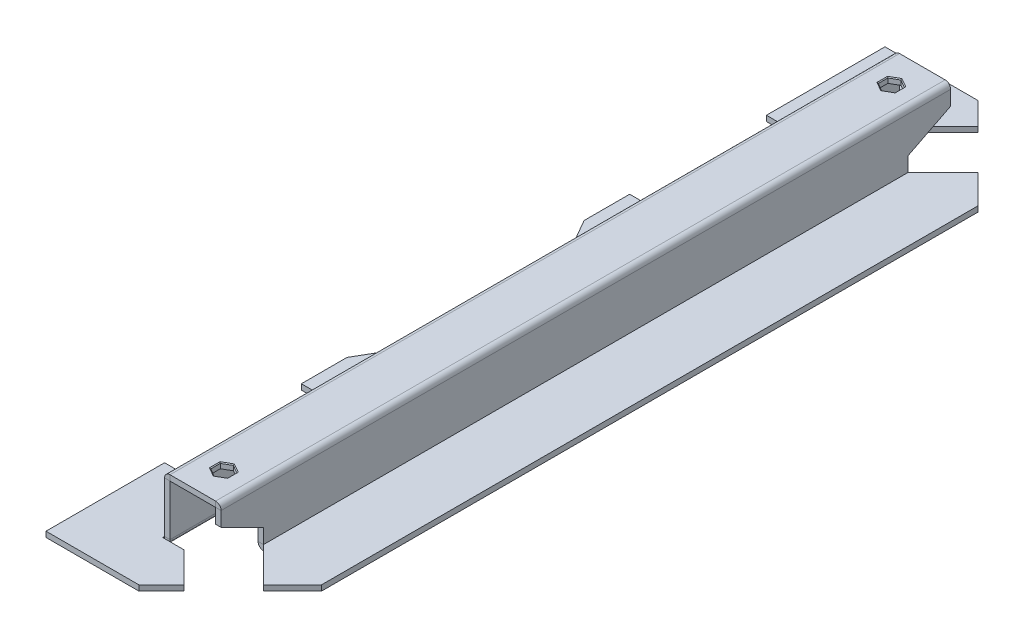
ISO-10303-21;
HEADER;
FILE_DESCRIPTION(('STEP AP214'),'2;1');
FILE_NAME('part.step','',(''),(''),'','','');
FILE_SCHEMA(('AUTOMOTIVE_DESIGN { 1 0 10303 214 1 1 1 1 }'));
ENDSEC;
DATA;
#1=APPLICATION_CONTEXT('core data for automotive mechanical design processes');
#2=APPLICATION_PROTOCOL_DEFINITION('international standard','automotive_design',2000,#1);
#3=PRODUCT_CONTEXT('',#1,'mechanical');
#4=PRODUCT('Part','Part','',(#3));
#5=PRODUCT_RELATED_PRODUCT_CATEGORY('part','',(#4));
#6=PRODUCT_DEFINITION_FORMATION('','',#4);
#7=PRODUCT_DEFINITION_CONTEXT('part definition',#1,'design');
#8=PRODUCT_DEFINITION('design','',#6,#7);
#9=PRODUCT_DEFINITION_SHAPE('','',#8);
#10=(LENGTH_UNIT() NAMED_UNIT(*) SI_UNIT(.MILLI.,.METRE.));
#11=(NAMED_UNIT(*) PLANE_ANGLE_UNIT() SI_UNIT($,.RADIAN.));
#12=(NAMED_UNIT(*) SI_UNIT($,.STERADIAN.) SOLID_ANGLE_UNIT());
#13=UNCERTAINTY_MEASURE_WITH_UNIT(LENGTH_MEASURE(1.E-05),#10,'distance_accuracy_value','');
#14=(GEOMETRIC_REPRESENTATION_CONTEXT(3) GLOBAL_UNCERTAINTY_ASSIGNED_CONTEXT((#13)) GLOBAL_UNIT_ASSIGNED_CONTEXT((#10,
#11,#12)) REPRESENTATION_CONTEXT('',''));
#15=CARTESIAN_POINT('',(0.,0.,0.));
#16=DIRECTION('',(0.,0.,1.));
#17=DIRECTION('',(1.,0.,0.));
#18=AXIS2_PLACEMENT_3D('',#15,#16,#17);
#19=CARTESIAN_POINT('',(-12.5,33.8,200.));
#20=DIRECTION('',(0.,1.,0.));
#21=DIRECTION('',(0.,0.,1.));
#22=AXIS2_PLACEMENT_3D('',#19,#20,#21);
#23=PLANE('',#22);
#24=DIRECTION('',(-0.866025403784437,0.,0.500000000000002));
#25=VECTOR('',#24,1.);
#26=CARTESIAN_POINT('',(-172.71886482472,33.8,-77.5072142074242));
#27=LINE('',#26,#25);
#28=CARTESIAN_POINT('',(5.00000000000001,33.8,-180.113248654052));
#29=VERTEX_POINT('',#28);
#30=CARTESIAN_POINT('',(0.,33.8,-177.226497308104));
#31=VERTEX_POINT('',#30);
#32=EDGE_CURVE('E890',#29,#31,#27,.T.);
#33=ORIENTED_EDGE('',*,*,#32,.T.);
#34=DIRECTION('',(-0.866025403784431,0.,-0.500000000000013));
#35=VECTOR('',#34,1.);
#36=CARTESIAN_POINT('',(153.968864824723,33.8,-88.3325317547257));
#37=LINE('',#36,#35);
#38=CARTESIAN_POINT('',(-5.,33.8,-180.113248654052));
#39=VERTEX_POINT('',#38);
#40=EDGE_CURVE('E914',#31,#39,#37,.T.);
#41=ORIENTED_EDGE('',*,*,#40,.T.);
#42=DIRECTION('',(0.,0.,-1.));
#43=VECTOR('',#42,1.);
#44=CARTESIAN_POINT('',(-4.99999999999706,33.8,200.));
#45=LINE('',#44,#43);
#46=CARTESIAN_POINT('',(-5.00000000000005,33.8,-185.886751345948));
#47=VERTEX_POINT('',#46);
#48=EDGE_CURVE('E912',#39,#47,#45,.T.);
#49=ORIENTED_EDGE('',*,*,#48,.T.);
#50=DIRECTION('',(0.866025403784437,0.,-0.500000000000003));
#51=VECTOR('',#50,1.);
#52=CARTESIAN_POINT('',(-177.718864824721,33.8,-86.1674682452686));
#53=LINE('',#52,#51);
#54=CARTESIAN_POINT('',(-1.66533453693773E-13,33.8,-188.773502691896));
#55=VERTEX_POINT('',#54);
#56=EDGE_CURVE('E910',#47,#55,#53,.T.);
#57=ORIENTED_EDGE('',*,*,#56,.T.);
#58=DIRECTION('',(0.866025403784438,0.,0.500000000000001));
#59=VECTOR('',#58,1.);
#60=CARTESIAN_POINT('',(158.96886482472,33.8,-96.9927857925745));
#61=LINE('',#60,#59);
#62=CARTESIAN_POINT('',(5.00000000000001,33.8,-185.886751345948));
#63=VERTEX_POINT('',#62);
#64=EDGE_CURVE('E908',#55,#63,#61,.T.);
#65=ORIENTED_EDGE('',*,*,#64,.T.);
#66=DIRECTION('',(0.,0.,1.));
#67=VECTOR('',#66,1.);
#68=CARTESIAN_POINT('',(5.00000000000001,33.8,200.));
#69=LINE('',#68,#67);
#70=EDGE_CURVE('E906',#63,#29,#69,.T.);
#71=ORIENTED_EDGE('',*,*,#70,.T.);
#72=EDGE_LOOP('',(#33,#41,#49,#57,#65,#71));
#73=FACE_BOUND('',#72,.T.);
#74=DIRECTION('',(1.,0.,0.));
#75=VECTOR('',#74,1.);
#76=CARTESIAN_POINT('',(-12.5,33.8,200.));
#77=LINE('',#76,#75);
#78=CARTESIAN_POINT('',(-12.5,33.8,200.));
#79=VERTEX_POINT('',#78);
#80=CARTESIAN_POINT('',(12.5,33.8,200.));
#81=VERTEX_POINT('',#80);
#82=EDGE_CURVE('E853',#79,#81,#77,.T.);
#83=ORIENTED_EDGE('',*,*,#82,.T.);
#84=DIRECTION('',(0.,0.,-1.));
#85=VECTOR('',#84,1.);
#86=CARTESIAN_POINT('',(12.5,33.8,200.));
#87=LINE('',#86,#85);
#88=CARTESIAN_POINT('',(12.5,33.8,-200.));
#89=VERTEX_POINT('',#88);
#90=EDGE_CURVE('E950',#81,#89,#87,.T.);
#91=ORIENTED_EDGE('',*,*,#90,.T.);
#92=DIRECTION('',(1.,0.,0.));
#93=VECTOR('',#92,1.);
#94=CARTESIAN_POINT('',(-12.5,33.8,-200.));
#95=LINE('',#94,#93);
#96=CARTESIAN_POINT('',(-12.5,33.8,-200.));
#97=VERTEX_POINT('',#96);
#98=EDGE_CURVE('E852',#97,#89,#95,.T.);
#99=ORIENTED_EDGE('',*,*,#98,.F.);
#100=DIRECTION('',(0.,0.,1.));
#101=VECTOR('',#100,1.);
#102=CARTESIAN_POINT('',(-12.5,33.8,200.));
#103=LINE('',#102,#101);
#104=EDGE_CURVE('E65',#97,#79,#103,.T.);
#105=ORIENTED_EDGE('',*,*,#104,.T.);
#106=EDGE_LOOP('',(#83,#91,#99,#105));
#107=FACE_BOUND('',#106,.T.);
#108=DIRECTION('',(0.,0.,-1.));
#109=VECTOR('',#108,1.);
#110=CARTESIAN_POINT('',(-4.99999999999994,33.8,180.373056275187));
#111=LINE('',#110,#109);
#112=CARTESIAN_POINT('',(-4.99999999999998,33.8,185.886751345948));
#113=VERTEX_POINT('',#112);
#114=CARTESIAN_POINT('',(-4.99999999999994,33.8,180.113248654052));
#115=VERTEX_POINT('',#114);
#116=EDGE_CURVE('E875',#113,#115,#111,.T.);
#117=ORIENTED_EDGE('',*,*,#116,.T.);
#118=DIRECTION('',(0.866025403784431,0.,-0.500000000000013));
#119=VECTOR('',#118,1.);
#120=CARTESIAN_POINT('',(-0.225000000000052,33.8,177.356401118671));
#121=LINE('',#120,#119);
#122=CARTESIAN_POINT('',(0.,33.8,177.226497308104));
#123=VERTEX_POINT('',#122);
#124=EDGE_CURVE('E877',#115,#123,#121,.T.);
#125=ORIENTED_EDGE('',*,*,#124,.T.);
#126=DIRECTION('',(0.866025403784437,0.,0.500000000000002));
#127=VECTOR('',#126,1.);
#128=CARTESIAN_POINT('',(4.77499999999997,33.8,179.983344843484));
#129=LINE('',#128,#127);
#130=CARTESIAN_POINT('',(4.99999999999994,33.8,180.113248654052));
#131=VERTEX_POINT('',#130);
#132=EDGE_CURVE('E867',#123,#131,#129,.T.);
#133=ORIENTED_EDGE('',*,*,#132,.T.);
#134=DIRECTION('',(0.,0.,1.));
#135=VECTOR('',#134,1.);
#136=CARTESIAN_POINT('',(4.99999999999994,33.8,185.626943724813));
#137=LINE('',#136,#135);
#138=CARTESIAN_POINT('',(4.99999999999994,33.8,185.886751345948));
#139=VERTEX_POINT('',#138);
#140=EDGE_CURVE('E869',#131,#139,#137,.T.);
#141=ORIENTED_EDGE('',*,*,#140,.T.);
#142=DIRECTION('',(-0.866025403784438,0.,0.500000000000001));
#143=VECTOR('',#142,1.);
#144=CARTESIAN_POINT('',(0.224999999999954,33.8,188.643598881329));
#145=LINE('',#144,#143);
#146=CARTESIAN_POINT('',(0.,33.8,188.773502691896));
#147=VERTEX_POINT('',#146);
#148=EDGE_CURVE('E871',#139,#147,#145,.T.);
#149=ORIENTED_EDGE('',*,*,#148,.T.);
#150=DIRECTION('',(-0.866025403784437,0.,-0.500000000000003));
#151=VECTOR('',#150,1.);
#152=CARTESIAN_POINT('',(-4.77500000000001,33.8,186.016655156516));
#153=LINE('',#152,#151);
#154=EDGE_CURVE('E873',#147,#113,#153,.T.);
#155=ORIENTED_EDGE('',*,*,#154,.T.);
#156=EDGE_LOOP('',(#117,#125,#133,#141,#149,#155));
#157=FACE_BOUND('',#156,.T.);
#158=ADVANCED_FACE('F42',(#73,#107,#157),#23,.T.);
#159=CARTESIAN_POINT('',(-12.5,30.8,200.));
#160=DIRECTION('',(0.,1.,0.));
#161=DIRECTION('',(0.,0.,1.));
#162=AXIS2_PLACEMENT_3D('',#159,#160,#161);
#163=PLANE('',#162);
#164=DIRECTION('',(1.,0.,0.));
#165=VECTOR('',#164,1.);
#166=CARTESIAN_POINT('',(-12.5,30.8,-200.));
#167=LINE('',#166,#165);
#168=CARTESIAN_POINT('',(-12.5,30.8,-200.));
#169=VERTEX_POINT('',#168);
#170=CARTESIAN_POINT('',(12.5,30.8,-200.));
#171=VERTEX_POINT('',#170);
#172=EDGE_CURVE('E857',#169,#171,#167,.T.);
#173=ORIENTED_EDGE('',*,*,#172,.T.);
#174=DIRECTION('',(0.,0.,-1.));
#175=VECTOR('',#174,1.);
#176=CARTESIAN_POINT('',(12.5,30.8,200.));
#177=LINE('',#176,#175);
#178=CARTESIAN_POINT('',(12.5,30.8,200.));
#179=VERTEX_POINT('',#178);
#180=EDGE_CURVE('E930',#179,#171,#177,.T.);
#181=ORIENTED_EDGE('',*,*,#180,.F.);
#182=DIRECTION('',(1.,0.,0.));
#183=VECTOR('',#182,1.);
#184=CARTESIAN_POINT('',(-12.5,30.8,200.));
#185=LINE('',#184,#183);
#186=CARTESIAN_POINT('',(-12.5,30.8,200.));
#187=VERTEX_POINT('',#186);
#188=EDGE_CURVE('E856',#187,#179,#185,.T.);
#189=ORIENTED_EDGE('',*,*,#188,.F.);
#190=DIRECTION('',(0.,0.,-1.));
#191=VECTOR('',#190,1.);
#192=CARTESIAN_POINT('',(-12.5,30.8,200.));
#193=LINE('',#192,#191);
#194=EDGE_CURVE('E469',#187,#169,#193,.T.);
#195=ORIENTED_EDGE('',*,*,#194,.T.);
#196=EDGE_LOOP('',(#173,#181,#189,#195));
#197=FACE_BOUND('',#196,.T.);
#198=DIRECTION('',(-0.866025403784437,0.,-0.500000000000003));
#199=VECTOR('',#198,1.);
#200=CARTESIAN_POINT('',(-4.55000000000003,30.8,185.626943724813));
#201=LINE('',#200,#199);
#202=CARTESIAN_POINT('',(0.,30.8,188.253887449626));
#203=VERTEX_POINT('',#202);
#204=CARTESIAN_POINT('',(-4.55000000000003,30.8,185.626943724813));
#205=VERTEX_POINT('',#204);
#206=EDGE_CURVE('E825',#203,#205,#201,.T.);
#207=ORIENTED_EDGE('',*,*,#206,.F.);
#208=DIRECTION('',(-0.866025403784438,0.,0.500000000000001));
#209=VECTOR('',#208,1.);
#210=CARTESIAN_POINT('',(0.,30.8,188.253887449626));
#211=LINE('',#210,#209);
#212=CARTESIAN_POINT('',(4.54999999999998,30.8,185.626943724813));
#213=VERTEX_POINT('',#212);
#214=EDGE_CURVE('E828',#213,#203,#211,.T.);
#215=ORIENTED_EDGE('',*,*,#214,.F.);
#216=DIRECTION('',(0.,0.,1.));
#217=VECTOR('',#216,1.);
#218=CARTESIAN_POINT('',(4.54999999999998,30.8,185.626943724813));
#219=LINE('',#218,#217);
#220=CARTESIAN_POINT('',(4.54999999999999,30.8,180.373056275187));
#221=VERTEX_POINT('',#220);
#222=EDGE_CURVE('E835',#221,#213,#219,.T.);
#223=ORIENTED_EDGE('',*,*,#222,.F.);
#224=DIRECTION('',(0.866025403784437,0.,0.500000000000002));
#225=VECTOR('',#224,1.);
#226=CARTESIAN_POINT('',(4.54999999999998,30.8,180.373056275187));
#227=LINE('',#226,#225);
#228=CARTESIAN_POINT('',(0.,30.8,177.746112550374));
#229=VERTEX_POINT('',#228);
#230=EDGE_CURVE('E816',#229,#221,#227,.T.);
#231=ORIENTED_EDGE('',*,*,#230,.F.);
#232=DIRECTION('',(0.866025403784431,0.,-0.500000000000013));
#233=VECTOR('',#232,1.);
#234=CARTESIAN_POINT('',(0.,30.8,177.746112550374));
#235=LINE('',#234,#233);
#236=CARTESIAN_POINT('',(-4.54999999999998,30.8,180.373056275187));
#237=VERTEX_POINT('',#236);
#238=EDGE_CURVE('E818',#237,#229,#235,.T.);
#239=ORIENTED_EDGE('',*,*,#238,.F.);
#240=DIRECTION('',(0.,0.,-1.));
#241=VECTOR('',#240,1.);
#242=CARTESIAN_POINT('',(-4.54999999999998,30.8,180.373056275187));
#243=LINE('',#242,#241);
#244=EDGE_CURVE('E822',#205,#237,#243,.T.);
#245=ORIENTED_EDGE('',*,*,#244,.F.);
#246=EDGE_LOOP('',(#207,#215,#223,#231,#239,#245));
#247=FACE_BOUND('',#246,.T.);
#248=DIRECTION('',(-0.866025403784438,0.,-0.500000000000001));
#249=VECTOR('',#248,1.);
#250=CARTESIAN_POINT('',(0.,30.8,-188.253887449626));
#251=LINE('',#250,#249);
#252=CARTESIAN_POINT('',(4.54999999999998,30.8,-185.626943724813));
#253=VERTEX_POINT('',#252);
#254=CARTESIAN_POINT('',(0.,30.8,-188.253887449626));
#255=VERTEX_POINT('',#254);
#256=EDGE_CURVE('E791',#253,#255,#251,.T.);
#257=ORIENTED_EDGE('',*,*,#256,.T.);
#258=DIRECTION('',(-0.866025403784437,0.,0.500000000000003));
#259=VECTOR('',#258,1.);
#260=CARTESIAN_POINT('',(-4.55000000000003,30.8,-185.626943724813));
#261=LINE('',#260,#259);
#262=CARTESIAN_POINT('',(-4.55000000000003,30.8,-185.626943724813));
#263=VERTEX_POINT('',#262);
#264=EDGE_CURVE('E798',#255,#263,#261,.T.);
#265=ORIENTED_EDGE('',*,*,#264,.T.);
#266=DIRECTION('',(0.,0.,1.));
#267=VECTOR('',#266,1.);
#268=CARTESIAN_POINT('',(-4.54999999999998,30.8,-180.373056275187));
#269=LINE('',#268,#267);
#270=CARTESIAN_POINT('',(-4.54999999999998,30.8,-180.373056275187));
#271=VERTEX_POINT('',#270);
#272=EDGE_CURVE('E778',#263,#271,#269,.T.);
#273=ORIENTED_EDGE('',*,*,#272,.T.);
#274=DIRECTION('',(0.866025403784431,0.,0.500000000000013));
#275=VECTOR('',#274,1.);
#276=CARTESIAN_POINT('',(0.,30.8,-177.746112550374));
#277=LINE('',#276,#275);
#278=CARTESIAN_POINT('',(0.,30.8,-177.746112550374));
#279=VERTEX_POINT('',#278);
#280=EDGE_CURVE('E781',#271,#279,#277,.T.);
#281=ORIENTED_EDGE('',*,*,#280,.T.);
#282=DIRECTION('',(0.866025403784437,0.,-0.500000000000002));
#283=VECTOR('',#282,1.);
#284=CARTESIAN_POINT('',(4.54999999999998,30.8,-180.373056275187));
#285=LINE('',#284,#283);
#286=CARTESIAN_POINT('',(4.54999999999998,30.8,-180.373056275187));
#287=VERTEX_POINT('',#286);
#288=EDGE_CURVE('E785',#279,#287,#285,.T.);
#289=ORIENTED_EDGE('',*,*,#288,.T.);
#290=DIRECTION('',(0.,0.,-1.));
#291=VECTOR('',#290,1.);
#292=CARTESIAN_POINT('',(4.54999999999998,30.8,-185.626943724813));
#293=LINE('',#292,#291);
#294=EDGE_CURVE('E788',#287,#253,#293,.T.);
#295=ORIENTED_EDGE('',*,*,#294,.T.);
#296=EDGE_LOOP('',(#257,#265,#273,#281,#289,#295));
#297=FACE_BOUND('',#296,.T.);
#298=ADVANCED_FACE('F1040',(#197,#247,#297),#163,.F.);
#299=CARTESIAN_POINT('',(-12.5,30.8,200.));
#300=DIRECTION('',(0.,0.,1.));
#301=DIRECTION('',(1.,0.,0.));
#302=AXIS2_PLACEMENT_3D('',#299,#300,#301);
#303=PLANE('',#302);
#304=DIRECTION('',(0.,1.,0.));
#305=VECTOR('',#304,1.);
#306=CARTESIAN_POINT('',(-12.5,30.8,200.));
#307=LINE('',#306,#305);
#308=EDGE_CURVE('E956',#187,#79,#307,.T.);
#309=ORIENTED_EDGE('',*,*,#308,.F.);
#310=ORIENTED_EDGE('',*,*,#188,.T.);
#311=DIRECTION('',(0.,1.,0.));
#312=VECTOR('',#311,1.);
#313=CARTESIAN_POINT('',(12.5,30.8,200.));
#314=LINE('',#313,#312);
#315=EDGE_CURVE('E953',#179,#81,#314,.T.);
#316=ORIENTED_EDGE('',*,*,#315,.T.);
#317=ORIENTED_EDGE('',*,*,#82,.F.);
#318=EDGE_LOOP('',(#309,#310,#316,#317));
#319=FACE_BOUND('',#318,.T.);
#320=ADVANCED_FACE('F1081',(#319),#303,.T.);
#321=CARTESIAN_POINT('',(12.5,30.8,-200.));
#322=DIRECTION('',(0.,0.,-1.));
#323=DIRECTION('',(-1.,0.,0.));
#324=AXIS2_PLACEMENT_3D('',#321,#322,#323);
#325=PLANE('',#324);
#326=DIRECTION('',(0.,1.,0.));
#327=VECTOR('',#326,1.);
#328=CARTESIAN_POINT('',(12.5,30.8,-200.));
#329=LINE('',#328,#327);
#330=EDGE_CURVE('E947',#171,#89,#329,.T.);
#331=ORIENTED_EDGE('',*,*,#330,.F.);
#332=ORIENTED_EDGE('',*,*,#172,.F.);
#333=DIRECTION('',(0.,1.,0.));
#334=VECTOR('',#333,1.);
#335=CARTESIAN_POINT('',(-12.5,30.8,-200.));
#336=LINE('',#335,#334);
#337=EDGE_CURVE('E960',#169,#97,#336,.T.);
#338=ORIENTED_EDGE('',*,*,#337,.T.);
#339=ORIENTED_EDGE('',*,*,#98,.T.);
#340=EDGE_LOOP('',(#331,#332,#338,#339));
#341=FACE_BOUND('',#340,.T.);
#342=ADVANCED_FACE('F1046',(#341),#325,.T.);
#343=CARTESIAN_POINT('',(0.,-0.000999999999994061,188.253887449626));
#344=DIRECTION('',(0.500000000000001,0.,0.866025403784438));
#345=DIRECTION('',(0.866025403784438,0.,-0.500000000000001));
#346=AXIS2_PLACEMENT_3D('',#343,#344,#345);
#347=PLANE('',#346);
#348=DIRECTION('',(0.,1.,0.));
#349=VECTOR('',#348,1.);
#350=CARTESIAN_POINT('',(0.,-0.000999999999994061,188.253887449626));
#351=LINE('',#350,#349);
#352=CARTESIAN_POINT('',(0.,33.35,188.253887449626));
#353=VERTEX_POINT('',#352);
#354=EDGE_CURVE('E832',#203,#353,#351,.T.);
#355=ORIENTED_EDGE('',*,*,#354,.T.);
#356=DIRECTION('',(0.866025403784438,0.,-0.500000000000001));
#357=VECTOR('',#356,1.);
#358=CARTESIAN_POINT('',(4.54999999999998,33.35,185.626943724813));
#359=LINE('',#358,#357);
#360=CARTESIAN_POINT('',(4.54999999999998,33.35,185.626943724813));
#361=VERTEX_POINT('',#360);
#362=EDGE_CURVE('E884',#353,#361,#359,.T.);
#363=ORIENTED_EDGE('',*,*,#362,.T.);
#364=DIRECTION('',(0.,1.,0.));
#365=VECTOR('',#364,1.);
#366=CARTESIAN_POINT('',(4.54999999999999,-0.000999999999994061,185.626943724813));
#367=LINE('',#366,#365);
#368=EDGE_CURVE('E831',#213,#361,#367,.T.);
#369=ORIENTED_EDGE('',*,*,#368,.F.);
#370=ORIENTED_EDGE('',*,*,#214,.T.);
#371=EDGE_LOOP('',(#355,#363,#369,#370));
#372=FACE_BOUND('',#371,.T.);
#373=ADVANCED_FACE('F1087',(#372),#347,.F.);
#374=CARTESIAN_POINT('',(-4.55000000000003,-0.000999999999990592,185.626943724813));
#375=DIRECTION('',(-0.500000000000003,0.,0.866025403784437));
#376=DIRECTION('',(0.866025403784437,0.,0.500000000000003));
#377=AXIS2_PLACEMENT_3D('',#374,#375,#376);
#378=PLANE('',#377);
#379=DIRECTION('',(0.,1.,0.));
#380=VECTOR('',#379,1.);
#381=CARTESIAN_POINT('',(-4.55000000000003,-0.000999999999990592,185.626943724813));
#382=LINE('',#381,#380);
#383=CARTESIAN_POINT('',(-4.55000000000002,33.35,185.626943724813));
#384=VERTEX_POINT('',#383);
#385=EDGE_CURVE('E836',#205,#384,#382,.T.);
#386=ORIENTED_EDGE('',*,*,#385,.T.);
#387=DIRECTION('',(0.866025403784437,0.,0.500000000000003));
#388=VECTOR('',#387,1.);
#389=CARTESIAN_POINT('',(0.,33.35,188.253887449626));
#390=LINE('',#389,#388);
#391=EDGE_CURVE('E882',#384,#353,#390,.T.);
#392=ORIENTED_EDGE('',*,*,#391,.T.);
#393=ORIENTED_EDGE('',*,*,#354,.F.);
#394=ORIENTED_EDGE('',*,*,#206,.T.);
#395=EDGE_LOOP('',(#386,#392,#393,#394));
#396=FACE_BOUND('',#395,.T.);
#397=ADVANCED_FACE('F1187',(#396),#378,.F.);
#398=CARTESIAN_POINT('',(-4.54999999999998,-0.000999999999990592,180.373056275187));
#399=DIRECTION('',(-1.,0.,0.));
#400=DIRECTION('',(0.,0.,1.));
#401=AXIS2_PLACEMENT_3D('',#398,#399,#400);
#402=PLANE('',#401);
#403=DIRECTION('',(0.,1.,0.));
#404=VECTOR('',#403,1.);
#405=CARTESIAN_POINT('',(-4.54999999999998,-0.000999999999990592,180.373056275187));
#406=LINE('',#405,#404);
#407=CARTESIAN_POINT('',(-4.54999999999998,33.35,180.373056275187));
#408=VERTEX_POINT('',#407);
#409=EDGE_CURVE('E839',#237,#408,#406,.T.);
#410=ORIENTED_EDGE('',*,*,#409,.T.);
#411=DIRECTION('',(0.,0.,1.));
#412=VECTOR('',#411,1.);
#413=CARTESIAN_POINT('',(-4.55000000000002,33.35,185.626943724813));
#414=LINE('',#413,#412);
#415=EDGE_CURVE('E880',#408,#384,#414,.T.);
#416=ORIENTED_EDGE('',*,*,#415,.T.);
#417=ORIENTED_EDGE('',*,*,#385,.F.);
#418=ORIENTED_EDGE('',*,*,#244,.T.);
#419=EDGE_LOOP('',(#410,#416,#417,#418));
#420=FACE_BOUND('',#419,.T.);
#421=ADVANCED_FACE('F1190',(#420),#402,.F.);
#422=CARTESIAN_POINT('',(0.,-0.000999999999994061,177.746112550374));
#423=DIRECTION('',(-0.500000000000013,0.,-0.866025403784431));
#424=DIRECTION('',(-0.866025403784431,0.,0.500000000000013));
#425=AXIS2_PLACEMENT_3D('',#422,#423,#424);
#426=PLANE('',#425);
#427=DIRECTION('',(0.,1.,0.));
#428=VECTOR('',#427,1.);
#429=CARTESIAN_POINT('',(0.,-0.000999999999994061,177.746112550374));
#430=LINE('',#429,#428);
#431=CARTESIAN_POINT('',(0.,33.35,177.746112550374));
#432=VERTEX_POINT('',#431);
#433=EDGE_CURVE('E842',#229,#432,#430,.T.);
#434=ORIENTED_EDGE('',*,*,#433,.T.);
#435=DIRECTION('',(-0.866025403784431,0.,0.500000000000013));
#436=VECTOR('',#435,1.);
#437=CARTESIAN_POINT('',(-4.54999999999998,33.35,180.373056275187));
#438=LINE('',#437,#436);
#439=EDGE_CURVE('E860',#432,#408,#438,.T.);
#440=ORIENTED_EDGE('',*,*,#439,.T.);
#441=ORIENTED_EDGE('',*,*,#409,.F.);
#442=ORIENTED_EDGE('',*,*,#238,.T.);
#443=EDGE_LOOP('',(#434,#440,#441,#442));
#444=FACE_BOUND('',#443,.T.);
#445=ADVANCED_FACE('F1194',(#444),#426,.F.);
#446=CARTESIAN_POINT('',(4.54999999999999,-0.000999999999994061,180.373056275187));
#447=DIRECTION('',(0.500000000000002,0.,-0.866025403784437));
#448=DIRECTION('',(-0.866025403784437,0.,-0.500000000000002));
#449=AXIS2_PLACEMENT_3D('',#446,#447,#448);
#450=PLANE('',#449);
#451=DIRECTION('',(0.,1.,0.));
#452=VECTOR('',#451,1.);
#453=CARTESIAN_POINT('',(4.54999999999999,-0.000999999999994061,180.373056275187));
#454=LINE('',#453,#452);
#455=CARTESIAN_POINT('',(4.54999999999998,33.35,180.373056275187));
#456=VERTEX_POINT('',#455);
#457=EDGE_CURVE('E845',#221,#456,#454,.T.);
#458=ORIENTED_EDGE('',*,*,#457,.T.);
#459=DIRECTION('',(-0.866025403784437,0.,-0.500000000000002));
#460=VECTOR('',#459,1.);
#461=CARTESIAN_POINT('',(0.,33.35,177.746112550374));
#462=LINE('',#461,#460);
#463=EDGE_CURVE('E888',#456,#432,#462,.T.);
#464=ORIENTED_EDGE('',*,*,#463,.T.);
#465=ORIENTED_EDGE('',*,*,#433,.F.);
#466=ORIENTED_EDGE('',*,*,#230,.T.);
#467=EDGE_LOOP('',(#458,#464,#465,#466));
#468=FACE_BOUND('',#467,.T.);
#469=ADVANCED_FACE('F1198',(#468),#450,.F.);
#470=CARTESIAN_POINT('',(4.54999999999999,-0.000999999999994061,185.626943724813));
#471=DIRECTION('',(1.,0.,0.));
#472=DIRECTION('',(0.,0.,-1.));
#473=AXIS2_PLACEMENT_3D('',#470,#471,#472);
#474=PLANE('',#473);
#475=ORIENTED_EDGE('',*,*,#368,.T.);
#476=DIRECTION('',(0.,0.,-1.));
#477=VECTOR('',#476,1.);
#478=CARTESIAN_POINT('',(4.54999999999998,33.35,180.373056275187));
#479=LINE('',#478,#477);
#480=EDGE_CURVE('E886',#361,#456,#479,.T.);
#481=ORIENTED_EDGE('',*,*,#480,.T.);
#482=ORIENTED_EDGE('',*,*,#457,.F.);
#483=ORIENTED_EDGE('',*,*,#222,.T.);
#484=EDGE_LOOP('',(#475,#481,#482,#483));
#485=FACE_BOUND('',#484,.T.);
#486=ADVANCED_FACE('F1115',(#485),#474,.F.);
#487=CARTESIAN_POINT('',(0.,33.35,188.253887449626));
#488=DIRECTION('',(-0.353553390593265,0.707106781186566,-0.612372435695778));
#489=DIRECTION('',(0.,0.654653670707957,0.755928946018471));
#490=AXIS2_PLACEMENT_3D('',#487,#488,#489);
#491=PLANE('',#490);
#492=DIRECTION('',(0.,0.654653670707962,0.755928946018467));
#493=VECTOR('',#492,1.);
#494=CARTESIAN_POINT('',(0.,32.05,186.752776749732));
#495=LINE('',#494,#493);
#496=EDGE_CURVE('E900',#147,#353,#495,.F.);
#497=ORIENTED_EDGE('',*,*,#496,.F.);
#498=ORIENTED_EDGE('',*,*,#148,.F.);
#499=DIRECTION('',(0.654653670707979,0.654653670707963,0.377964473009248));
#500=VECTOR('',#499,1.);
#501=CARTESIAN_POINT('',(3.25000000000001,32.0500000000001,184.876388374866));
#502=LINE('',#501,#500);
#503=EDGE_CURVE('E819',#361,#139,#502,.T.);
#504=ORIENTED_EDGE('',*,*,#503,.F.);
#505=ORIENTED_EDGE('',*,*,#362,.F.);
#506=EDGE_LOOP('',(#497,#498,#504,#505));
#507=FACE_BOUND('',#506,.T.);
#508=ADVANCED_FACE('F1111',(#507),#491,.T.);
#509=CARTESIAN_POINT('',(4.54999999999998,33.35,185.626943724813));
#510=DIRECTION('',(-0.707106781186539,0.707106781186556,0.));
#511=DIRECTION('',(-0.707106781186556,-0.707106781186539,0.));
#512=AXIS2_PLACEMENT_3D('',#509,#510,#511);
#513=PLANE('',#512);
#514=ORIENTED_EDGE('',*,*,#503,.T.);
#515=ORIENTED_EDGE('',*,*,#140,.F.);
#516=DIRECTION('',(0.654653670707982,0.654653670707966,-0.377964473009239));
#517=VECTOR('',#516,1.);
#518=CARTESIAN_POINT('',(3.24999999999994,32.05,181.123611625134));
#519=LINE('',#518,#517);
#520=EDGE_CURVE('E897',#456,#131,#519,.T.);
#521=ORIENTED_EDGE('',*,*,#520,.F.);
#522=ORIENTED_EDGE('',*,*,#480,.F.);
#523=EDGE_LOOP('',(#514,#515,#521,#522));
#524=FACE_BOUND('',#523,.T.);
#525=ADVANCED_FACE('F1107',(#524),#513,.T.);
#526=CARTESIAN_POINT('',(-4.55000000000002,33.35,185.626943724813));
#527=DIRECTION('',(0.353553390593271,0.707106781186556,-0.612372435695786));
#528=DIRECTION('',(0.,0.654653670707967,0.755928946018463));
#529=AXIS2_PLACEMENT_3D('',#526,#527,#528);
#530=PLANE('',#529);
#531=ORIENTED_EDGE('',*,*,#496,.T.);
#532=ORIENTED_EDGE('',*,*,#391,.F.);
#533=DIRECTION('',(-0.654653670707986,0.654653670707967,0.377964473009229));
#534=VECTOR('',#533,1.);
#535=CARTESIAN_POINT('',(-3.25,32.05,184.876388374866));
#536=LINE('',#535,#534);
#537=EDGE_CURVE('E894',#113,#384,#536,.F.);
#538=ORIENTED_EDGE('',*,*,#537,.F.);
#539=ORIENTED_EDGE('',*,*,#154,.F.);
#540=EDGE_LOOP('',(#531,#532,#538,#539));
#541=FACE_BOUND('',#540,.T.);
#542=ADVANCED_FACE('F1103',(#541),#530,.T.);
#543=CARTESIAN_POINT('',(4.54999999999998,33.35,180.373056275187));
#544=DIRECTION('',(-0.353553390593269,0.707106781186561,0.612372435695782));
#545=DIRECTION('',(0.,-0.654653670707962,0.755928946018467));
#546=AXIS2_PLACEMENT_3D('',#543,#544,#545);
#547=PLANE('',#546);
#548=ORIENTED_EDGE('',*,*,#520,.T.);
#549=ORIENTED_EDGE('',*,*,#132,.F.);
#550=DIRECTION('',(0.,-0.654653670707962,0.755928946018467));
#551=VECTOR('',#550,1.);
#552=CARTESIAN_POINT('',(0.,33.35,177.746112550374));
#553=LINE('',#552,#551);
#554=EDGE_CURVE('E892',#432,#123,#553,.F.);
#555=ORIENTED_EDGE('',*,*,#554,.F.);
#556=ORIENTED_EDGE('',*,*,#463,.F.);
#557=EDGE_LOOP('',(#548,#549,#555,#556));
#558=FACE_BOUND('',#557,.T.);
#559=ADVANCED_FACE('F1099',(#558),#547,.T.);
#560=CARTESIAN_POINT('',(-4.54999999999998,33.35,180.373056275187));
#561=DIRECTION('',(0.707106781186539,0.707106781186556,0.));
#562=DIRECTION('',(-0.707106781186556,0.707106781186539,0.));
#563=AXIS2_PLACEMENT_3D('',#560,#561,#562);
#564=PLANE('',#563);
#565=ORIENTED_EDGE('',*,*,#537,.T.);
#566=ORIENTED_EDGE('',*,*,#415,.F.);
#567=DIRECTION('',(-0.654653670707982,0.654653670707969,-0.377964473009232));
#568=VECTOR('',#567,1.);
#569=CARTESIAN_POINT('',(-3.25000000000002,32.0500000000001,181.123611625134));
#570=LINE('',#569,#568);
#571=EDGE_CURVE('E815',#115,#408,#570,.F.);
#572=ORIENTED_EDGE('',*,*,#571,.F.);
#573=ORIENTED_EDGE('',*,*,#116,.F.);
#574=EDGE_LOOP('',(#565,#566,#572,#573));
#575=FACE_BOUND('',#574,.T.);
#576=ADVANCED_FACE('F1095',(#575),#564,.T.);
#577=CARTESIAN_POINT('',(0.,33.35,177.746112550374));
#578=DIRECTION('',(0.353553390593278,0.707106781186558,0.61237243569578));
#579=DIRECTION('',(0.,-0.654653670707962,0.755928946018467));
#580=AXIS2_PLACEMENT_3D('',#577,#578,#579);
#581=PLANE('',#580);
#582=ORIENTED_EDGE('',*,*,#554,.T.);
#583=ORIENTED_EDGE('',*,*,#124,.F.);
#584=ORIENTED_EDGE('',*,*,#571,.T.);
#585=ORIENTED_EDGE('',*,*,#439,.F.);
#586=EDGE_LOOP('',(#582,#583,#584,#585));
#587=FACE_BOUND('',#586,.T.);
#588=ADVANCED_FACE('F1091',(#587),#581,.T.);
#589=CARTESIAN_POINT('',(0.,-0.000999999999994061,-188.253887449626));
#590=DIRECTION('',(-0.500000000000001,0.,0.866025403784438));
#591=DIRECTION('',(0.866025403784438,0.,0.500000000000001));
#592=AXIS2_PLACEMENT_3D('',#589,#590,#591);
#593=PLANE('',#592);
#594=DIRECTION('',(0.,1.,0.));
#595=VECTOR('',#594,1.);
#596=CARTESIAN_POINT('',(4.54999999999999,-0.000999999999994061,-185.626943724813));
#597=LINE('',#596,#595);
#598=CARTESIAN_POINT('',(4.54999999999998,33.35,-185.626943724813));
#599=VERTEX_POINT('',#598);
#600=EDGE_CURVE('E795',#253,#599,#597,.T.);
#601=ORIENTED_EDGE('',*,*,#600,.T.);
#602=DIRECTION('',(-0.866025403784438,0.,-0.500000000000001));
#603=VECTOR('',#602,1.);
#604=CARTESIAN_POINT('',(0.,33.35,-188.253887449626));
#605=LINE('',#604,#603);
#606=CARTESIAN_POINT('',(0.,33.35,-188.253887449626));
#607=VERTEX_POINT('',#606);
#608=EDGE_CURVE('E924',#599,#607,#605,.T.);
#609=ORIENTED_EDGE('',*,*,#608,.T.);
#610=DIRECTION('',(0.,1.,0.));
#611=VECTOR('',#610,1.);
#612=CARTESIAN_POINT('',(0.,-0.000999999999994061,-188.253887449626));
#613=LINE('',#612,#611);
#614=EDGE_CURVE('E794',#255,#607,#613,.T.);
#615=ORIENTED_EDGE('',*,*,#614,.F.);
#616=ORIENTED_EDGE('',*,*,#256,.F.);
#617=EDGE_LOOP('',(#601,#609,#615,#616));
#618=FACE_BOUND('',#617,.T.);
#619=ADVANCED_FACE('F1094',(#618),#593,.T.);
#620=CARTESIAN_POINT('',(4.54999999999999,-0.000999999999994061,-185.626943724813));
#621=DIRECTION('',(-1.,0.,0.));
#622=DIRECTION('',(0.,0.,1.));
#623=AXIS2_PLACEMENT_3D('',#620,#621,#622);
#624=PLANE('',#623);
#625=DIRECTION('',(0.,1.,0.));
#626=VECTOR('',#625,1.);
#627=CARTESIAN_POINT('',(4.54999999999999,-0.000999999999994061,-180.373056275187));
#628=LINE('',#627,#626);
#629=CARTESIAN_POINT('',(4.54999999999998,33.35,-180.373056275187));
#630=VERTEX_POINT('',#629);
#631=EDGE_CURVE('E799',#287,#630,#628,.T.);
#632=ORIENTED_EDGE('',*,*,#631,.T.);
#633=DIRECTION('',(0.,0.,-1.));
#634=VECTOR('',#633,1.);
#635=CARTESIAN_POINT('',(4.54999999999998,33.35,-185.626943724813));
#636=LINE('',#635,#634);
#637=EDGE_CURVE('E926',#630,#599,#636,.T.);
#638=ORIENTED_EDGE('',*,*,#637,.T.);
#639=ORIENTED_EDGE('',*,*,#600,.F.);
#640=ORIENTED_EDGE('',*,*,#294,.F.);
#641=EDGE_LOOP('',(#632,#638,#639,#640));
#642=FACE_BOUND('',#641,.T.);
#643=ADVANCED_FACE('F1155',(#642),#624,.T.);
#644=CARTESIAN_POINT('',(4.54999999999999,-0.000999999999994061,-180.373056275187));
#645=DIRECTION('',(-0.500000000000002,0.,-0.866025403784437));
#646=DIRECTION('',(-0.866025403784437,0.,0.500000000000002));
#647=AXIS2_PLACEMENT_3D('',#644,#645,#646);
#648=PLANE('',#647);
#649=DIRECTION('',(0.,1.,0.));
#650=VECTOR('',#649,1.);
#651=CARTESIAN_POINT('',(0.,-0.000999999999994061,-177.746112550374));
#652=LINE('',#651,#650);
#653=CARTESIAN_POINT('',(0.,33.35,-177.746112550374));
#654=VERTEX_POINT('',#653);
#655=EDGE_CURVE('E802',#279,#654,#652,.T.);
#656=ORIENTED_EDGE('',*,*,#655,.T.);
#657=DIRECTION('',(0.866025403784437,0.,-0.500000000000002));
#658=VECTOR('',#657,1.);
#659=CARTESIAN_POINT('',(4.54999999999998,33.35,-180.373056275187));
#660=LINE('',#659,#658);
#661=EDGE_CURVE('E928',#654,#630,#660,.T.);
#662=ORIENTED_EDGE('',*,*,#661,.T.);
#663=ORIENTED_EDGE('',*,*,#631,.F.);
#664=ORIENTED_EDGE('',*,*,#288,.F.);
#665=EDGE_LOOP('',(#656,#662,#663,#664));
#666=FACE_BOUND('',#665,.T.);
#667=ADVANCED_FACE('F1158',(#666),#648,.T.);
#668=CARTESIAN_POINT('',(0.,-0.000999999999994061,-177.746112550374));
#669=DIRECTION('',(0.500000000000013,0.,-0.866025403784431));
#670=DIRECTION('',(-0.866025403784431,0.,-0.500000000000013));
#671=AXIS2_PLACEMENT_3D('',#668,#669,#670);
#672=PLANE('',#671);
#673=DIRECTION('',(0.,1.,0.));
#674=VECTOR('',#673,1.);
#675=CARTESIAN_POINT('',(-4.54999999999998,-0.000999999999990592,-180.373056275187));
#676=LINE('',#675,#674);
#677=CARTESIAN_POINT('',(-4.54999999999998,33.35,-180.373056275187));
#678=VERTEX_POINT('',#677);
#679=EDGE_CURVE('E805',#271,#678,#676,.T.);
#680=ORIENTED_EDGE('',*,*,#679,.T.);
#681=DIRECTION('',(0.866025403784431,0.,0.500000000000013));
#682=VECTOR('',#681,1.);
#683=CARTESIAN_POINT('',(0.,33.35,-177.746112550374));
#684=LINE('',#683,#682);
#685=EDGE_CURVE('E917',#678,#654,#684,.T.);
#686=ORIENTED_EDGE('',*,*,#685,.T.);
#687=ORIENTED_EDGE('',*,*,#655,.F.);
#688=ORIENTED_EDGE('',*,*,#280,.F.);
#689=EDGE_LOOP('',(#680,#686,#687,#688));
#690=FACE_BOUND('',#689,.T.);
#691=ADVANCED_FACE('F1163',(#690),#672,.T.);
#692=CARTESIAN_POINT('',(-4.54999999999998,-0.000999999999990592,-180.373056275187));
#693=DIRECTION('',(1.,0.,0.));
#694=DIRECTION('',(0.,0.,-1.));
#695=AXIS2_PLACEMENT_3D('',#692,#693,#694);
#696=PLANE('',#695);
#697=DIRECTION('',(0.,1.,0.));
#698=VECTOR('',#697,1.);
#699=CARTESIAN_POINT('',(-4.55000000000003,-0.000999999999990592,-185.626943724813));
#700=LINE('',#699,#698);
#701=CARTESIAN_POINT('',(-4.55000000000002,33.35,-185.626943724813));
#702=VERTEX_POINT('',#701);
#703=EDGE_CURVE('E808',#263,#702,#700,.T.);
#704=ORIENTED_EDGE('',*,*,#703,.T.);
#705=DIRECTION('',(0.,0.,1.));
#706=VECTOR('',#705,1.);
#707=CARTESIAN_POINT('',(-4.54999999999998,33.35,-180.373056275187));
#708=LINE('',#707,#706);
#709=EDGE_CURVE('E920',#702,#678,#708,.T.);
#710=ORIENTED_EDGE('',*,*,#709,.T.);
#711=ORIENTED_EDGE('',*,*,#679,.F.);
#712=ORIENTED_EDGE('',*,*,#272,.F.);
#713=EDGE_LOOP('',(#704,#710,#711,#712));
#714=FACE_BOUND('',#713,.T.);
#715=ADVANCED_FACE('F1166',(#714),#696,.T.);
#716=CARTESIAN_POINT('',(-4.55000000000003,-0.000999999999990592,-185.626943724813));
#717=DIRECTION('',(0.500000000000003,0.,0.866025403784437));
#718=DIRECTION('',(0.866025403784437,0.,-0.500000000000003));
#719=AXIS2_PLACEMENT_3D('',#716,#717,#718);
#720=PLANE('',#719);
#721=ORIENTED_EDGE('',*,*,#614,.T.);
#722=DIRECTION('',(-0.866025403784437,0.,0.500000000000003));
#723=VECTOR('',#722,1.);
#724=CARTESIAN_POINT('',(-4.55000000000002,33.35,-185.626943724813));
#725=LINE('',#724,#723);
#726=EDGE_CURVE('E922',#607,#702,#725,.T.);
#727=ORIENTED_EDGE('',*,*,#726,.T.);
#728=ORIENTED_EDGE('',*,*,#703,.F.);
#729=ORIENTED_EDGE('',*,*,#264,.F.);
#730=EDGE_LOOP('',(#721,#727,#728,#729));
#731=FACE_BOUND('',#730,.T.);
#732=ADVANCED_FACE('F1138',(#731),#720,.T.);
#733=CARTESIAN_POINT('',(158.96886482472,33.8,-96.9927857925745));
#734=DIRECTION('',(0.353553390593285,-0.707106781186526,-0.612372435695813));
#735=DIRECTION('',(0.,0.654653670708,-0.755928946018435));
#736=AXIS2_PLACEMENT_3D('',#733,#734,#735);
#737=PLANE('',#736);
#738=DIRECTION('',(1.6217078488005E-13,-0.654653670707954,0.755928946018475));
#739=VECTOR('',#738,1.);
#740=CARTESIAN_POINT('',(1.24067423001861E-11,-16.9768185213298,-130.141483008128));
#741=LINE('',#740,#739);
#742=EDGE_CURVE('E940',#607,#55,#741,.F.);
#743=ORIENTED_EDGE('',*,*,#742,.F.);
#744=ORIENTED_EDGE('',*,*,#608,.F.);
#745=DIRECTION('',(-0.654653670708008,-0.654653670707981,0.377964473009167));
#746=VECTOR('',#745,1.);
#747=CARTESIAN_POINT('',(48.9911042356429,77.7911042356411,-211.28502721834));
#748=LINE('',#747,#746);
#749=EDGE_CURVE('E782',#63,#599,#748,.T.);
#750=ORIENTED_EDGE('',*,*,#749,.F.);
#751=ORIENTED_EDGE('',*,*,#64,.F.);
#752=EDGE_LOOP('',(#743,#744,#750,#751));
#753=FACE_BOUND('',#752,.T.);
#754=ADVANCED_FACE('F44',(#753),#737,.F.);
#755=CARTESIAN_POINT('',(5.00000000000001,33.8,200.));
#756=DIRECTION('',(0.707106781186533,-0.707106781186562,0.));
#757=DIRECTION('',(0.707106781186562,0.707106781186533,0.));
#758=AXIS2_PLACEMENT_3D('',#755,#756,#757);
#759=PLANE('',#758);
#760=ORIENTED_EDGE('',*,*,#749,.T.);
#761=ORIENTED_EDGE('',*,*,#637,.F.);
#762=DIRECTION('',(-0.654653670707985,-0.654653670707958,-0.377964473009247));
#763=VECTOR('',#762,1.);
#764=CARTESIAN_POINT('',(99.053637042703,127.853637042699,-125.811355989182));
#765=LINE('',#764,#763);
#766=EDGE_CURVE('E937',#29,#630,#765,.T.);
#767=ORIENTED_EDGE('',*,*,#766,.F.);
#768=ORIENTED_EDGE('',*,*,#70,.F.);
#769=EDGE_LOOP('',(#760,#761,#767,#768));
#770=FACE_BOUND('',#769,.T.);
#771=ADVANCED_FACE('F1131',(#770),#759,.F.);
#772=CARTESIAN_POINT('',(-177.718864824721,33.8,-86.1674682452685));
#773=DIRECTION('',(-0.353553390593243,-0.707106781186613,-0.612372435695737));
#774=DIRECTION('',(0.,0.654653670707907,-0.755928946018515));
#775=AXIS2_PLACEMENT_3D('',#772,#773,#774);
#776=PLANE('',#775);
#777=ORIENTED_EDGE('',*,*,#742,.T.);
#778=ORIENTED_EDGE('',*,*,#56,.F.);
#779=DIRECTION('',(0.654653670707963,-0.654653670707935,0.377964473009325));
#780=VECTOR('',#779,1.);
#781=CARTESIAN_POINT('',(90.4822084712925,-61.6822084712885,-130.760072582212));
#782=LINE('',#781,#780);
#783=EDGE_CURVE('E934',#702,#47,#782,.F.);
#784=ORIENTED_EDGE('',*,*,#783,.F.);
#785=ORIENTED_EDGE('',*,*,#726,.F.);
#786=EDGE_LOOP('',(#777,#778,#784,#785));
#787=FACE_BOUND('',#786,.T.);
#788=ADVANCED_FACE('F1128',(#787),#776,.F.);
#789=CARTESIAN_POINT('',(-172.71886482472,33.8,-77.5072142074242));
#790=DIRECTION('',(0.353553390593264,-0.707106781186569,0.612372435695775));
#791=DIRECTION('',(0.,-0.654653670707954,-0.755928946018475));
#792=AXIS2_PLACEMENT_3D('',#789,#790,#791);
#793=PLANE('',#792);
#794=ORIENTED_EDGE('',*,*,#766,.T.);
#795=ORIENTED_EDGE('',*,*,#661,.F.);
#796=DIRECTION('',(0.,0.654653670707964,0.755928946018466));
#797=VECTOR('',#796,1.);
#798=CARTESIAN_POINT('',(2.38004060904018E-12,77.79110423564,-126.429945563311));
#799=LINE('',#798,#797);
#800=EDGE_CURVE('E932',#31,#654,#799,.F.);
#801=ORIENTED_EDGE('',*,*,#800,.F.);
#802=ORIENTED_EDGE('',*,*,#32,.F.);
#803=EDGE_LOOP('',(#794,#795,#801,#802));
#804=FACE_BOUND('',#803,.T.);
#805=ADVANCED_FACE('F1124',(#804),#793,.F.);
#806=CARTESIAN_POINT('',(-4.99999999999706,33.8,200.));
#807=DIRECTION('',(-0.707106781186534,-0.707106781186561,0.));
#808=DIRECTION('',(0.707106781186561,-0.707106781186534,0.));
#809=AXIS2_PLACEMENT_3D('',#806,#807,#808);
#810=PLANE('',#809);
#811=ORIENTED_EDGE('',*,*,#783,.T.);
#812=ORIENTED_EDGE('',*,*,#48,.F.);
#813=DIRECTION('',(0.654653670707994,-0.654653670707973,-0.377964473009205));
#814=VECTOR('',#813,1.);
#815=CARTESIAN_POINT('',(40.4196756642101,-11.6196756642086,-206.336310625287));
#816=LINE('',#815,#814);
#817=EDGE_CURVE('E777',#678,#39,#816,.F.);
#818=ORIENTED_EDGE('',*,*,#817,.F.);
#819=ORIENTED_EDGE('',*,*,#709,.F.);
#820=EDGE_LOOP('',(#811,#812,#818,#819));
#821=FACE_BOUND('',#820,.T.);
#822=ADVANCED_FACE('F1120',(#821),#810,.F.);
#823=CARTESIAN_POINT('',(153.968864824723,33.8,-88.3325317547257));
#824=DIRECTION('',(-0.353553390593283,-0.707106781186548,0.612372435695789));
#825=DIRECTION('',(0.,-0.654653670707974,-0.755928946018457));
#826=AXIS2_PLACEMENT_3D('',#823,#824,#825);
#827=PLANE('',#826);
#828=ORIENTED_EDGE('',*,*,#800,.T.);
#829=ORIENTED_EDGE('',*,*,#685,.F.);
#830=ORIENTED_EDGE('',*,*,#817,.T.);
#831=ORIENTED_EDGE('',*,*,#40,.F.);
#832=EDGE_LOOP('',(#828,#829,#830,#831));
#833=FACE_BOUND('',#832,.T.);
#834=ADVANCED_FACE('F1117',(#833),#827,.F.);
#835=CARTESIAN_POINT('',(12.5,30.8,-200.));
#836=DIRECTION('',(0.,0.,1.));
#837=DIRECTION('',(0.,-1.,0.));
#838=AXIS2_PLACEMENT_3D('',#835,#836,#837);
#839=PLANE('',#838);
#840=CARTESIAN_POINT('',(12.5,30.8,-200.));
#841=DIRECTION('',(0.,0.,1.));
#842=DIRECTION('',(0.,-1.,0.));
#843=AXIS2_PLACEMENT_3D('',#840,#841,#842);
#844=CIRCLE('',#843,3.);
#845=CARTESIAN_POINT('',(15.5,30.8,-200.));
#846=VERTEX_POINT('',#845);
#847=EDGE_CURVE('E775',#846,#89,#844,.T.);
#848=ORIENTED_EDGE('',*,*,#847,.F.);
#849=DIRECTION('',(1.,0.,0.));
#850=VECTOR('',#849,1.);
#851=CARTESIAN_POINT('',(12.5,30.8,-200.));
#852=LINE('',#851,#850);
#853=EDGE_CURVE('E738',#171,#846,#852,.T.);
#854=ORIENTED_EDGE('',*,*,#853,.F.);
#855=ORIENTED_EDGE('',*,*,#330,.T.);
#856=EDGE_LOOP('',(#848,#854,#855));
#857=FACE_BOUND('',#856,.T.);
#858=ADVANCED_FACE('F1035',(#857),#839,.F.);
#859=CARTESIAN_POINT('',(12.5,30.8,200.));
#860=DIRECTION('',(0.,0.,1.));
#861=DIRECTION('',(0.,-1.,0.));
#862=AXIS2_PLACEMENT_3D('',#859,#860,#861);
#863=CYLINDRICAL_SURFACE('',#862,3.);
#864=CARTESIAN_POINT('',(12.5,30.8,200.));
#865=DIRECTION('',(0.,0.,1.));
#866=DIRECTION('',(0.,-1.,0.));
#867=AXIS2_PLACEMENT_3D('',#864,#865,#866);
#868=CIRCLE('',#867,3.);
#869=CARTESIAN_POINT('',(15.5,30.7999999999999,200.));
#870=VERTEX_POINT('',#869);
#871=EDGE_CURVE('E723',#870,#81,#868,.T.);
#872=ORIENTED_EDGE('',*,*,#871,.F.);
#873=DIRECTION('',(0.,0.,1.));
#874=VECTOR('',#873,1.);
#875=CARTESIAN_POINT('',(15.5,30.8,200.));
#876=LINE('',#875,#874);
#877=EDGE_CURVE('E735',#846,#870,#876,.T.);
#878=ORIENTED_EDGE('',*,*,#877,.F.);
#879=ORIENTED_EDGE('',*,*,#847,.T.);
#880=ORIENTED_EDGE('',*,*,#90,.F.);
#881=EDGE_LOOP('',(#872,#878,#879,#880));
#882=FACE_BOUND('',#881,.T.);
#883=ADVANCED_FACE('F1052',(#882),#863,.T.);
#884=CARTESIAN_POINT('',(12.5,30.8,200.));
#885=DIRECTION('',(0.,0.,1.));
#886=DIRECTION('',(0.,-1.,0.));
#887=AXIS2_PLACEMENT_3D('',#884,#885,#886);
#888=PLANE('',#887);
#889=DIRECTION('',(1.,0.,0.));
#890=VECTOR('',#889,1.);
#891=CARTESIAN_POINT('',(12.5,30.8,200.));
#892=LINE('',#891,#890);
#893=EDGE_CURVE('E473',#179,#870,#892,.T.);
#894=ORIENTED_EDGE('',*,*,#893,.T.);
#895=ORIENTED_EDGE('',*,*,#871,.T.);
#896=ORIENTED_EDGE('',*,*,#315,.F.);
#897=EDGE_LOOP('',(#894,#895,#896));
#898=FACE_BOUND('',#897,.T.);
#899=ADVANCED_FACE('F1054',(#898),#888,.T.);
#900=CARTESIAN_POINT('',(12.5,22.8,-200.));
#901=DIRECTION('',(0.,0.891940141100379,0.452153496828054));
#902=DIRECTION('',(0.,-0.452153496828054,0.891940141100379));
#903=AXIS2_PLACEMENT_3D('',#900,#901,#902);
#904=PLANE('',#903);
#905=DIRECTION('',(0.,-0.452153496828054,0.891940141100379));
#906=VECTOR('',#905,1.);
#907=CARTESIAN_POINT('',(12.5,22.8,-200.));
#908=LINE('',#907,#906);
#909=CARTESIAN_POINT('',(12.5,22.8,-200.));
#910=VERTEX_POINT('',#909);
#911=CARTESIAN_POINT('',(12.5,11.0000000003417,-176.722741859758));
#912=VERTEX_POINT('',#911);
#913=EDGE_CURVE('E744',#910,#912,#908,.T.);
#914=ORIENTED_EDGE('',*,*,#913,.F.);
#915=DIRECTION('',(-1.,0.,0.));
#916=VECTOR('',#915,1.);
#917=CARTESIAN_POINT('',(12.5,22.8,-200.));
#918=LINE('',#917,#916);
#919=CARTESIAN_POINT('',(15.5,22.8,-200.));
#920=VERTEX_POINT('',#919);
#921=EDGE_CURVE('E769',#910,#920,#918,.F.);
#922=ORIENTED_EDGE('',*,*,#921,.T.);
#923=DIRECTION('',(0.,-0.452153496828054,0.891940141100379));
#924=VECTOR('',#923,1.);
#925=CARTESIAN_POINT('',(15.5,22.8,-200.));
#926=LINE('',#925,#924);
#927=CARTESIAN_POINT('',(15.5,11.0000000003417,-176.722741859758));
#928=VERTEX_POINT('',#927);
#929=EDGE_CURVE('E767',#920,#928,#926,.T.);
#930=ORIENTED_EDGE('',*,*,#929,.T.);
#931=DIRECTION('',(-1.,0.,0.));
#932=VECTOR('',#931,1.);
#933=CARTESIAN_POINT('',(12.5,11.0000000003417,-176.722741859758));
#934=LINE('',#933,#932);
#935=EDGE_CURVE('E756',#912,#928,#934,.F.);
#936=ORIENTED_EDGE('',*,*,#935,.F.);
#937=EDGE_LOOP('',(#914,#922,#930,#936));
#938=FACE_BOUND('',#937,.T.);
#939=ADVANCED_FACE('F1027',(#938),#904,.F.);
#940=CARTESIAN_POINT('',(12.5,22.8,200.));
#941=DIRECTION('',(0.,-0.891940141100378,0.452153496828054));
#942=DIRECTION('',(0.,-0.452153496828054,-0.891940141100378));
#943=AXIS2_PLACEMENT_3D('',#940,#941,#942);
#944=PLANE('',#943);
#945=DIRECTION('',(-1.,0.,0.));
#946=VECTOR('',#945,1.);
#947=CARTESIAN_POINT('',(12.5,22.8,200.));
#948=LINE('',#947,#946);
#949=CARTESIAN_POINT('',(12.5,22.8,200.));
#950=VERTEX_POINT('',#949);
#951=CARTESIAN_POINT('',(15.5,22.8,200.));
#952=VERTEX_POINT('',#951);
#953=EDGE_CURVE('E720',#950,#952,#948,.F.);
#954=ORIENTED_EDGE('',*,*,#953,.F.);
#955=DIRECTION('',(0.,-0.452153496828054,-0.891940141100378));
#956=VECTOR('',#955,1.);
#957=CARTESIAN_POINT('',(12.5,22.8,200.));
#958=LINE('',#957,#956);
#959=CARTESIAN_POINT('',(12.5,11.0000000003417,176.722741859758));
#960=VERTEX_POINT('',#959);
#961=EDGE_CURVE('E765',#950,#960,#958,.T.);
#962=ORIENTED_EDGE('',*,*,#961,.T.);
#963=DIRECTION('',(-1.,0.,0.));
#964=VECTOR('',#963,1.);
#965=CARTESIAN_POINT('',(12.5,11.0000000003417,176.722741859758));
#966=LINE('',#965,#964);
#967=CARTESIAN_POINT('',(15.5,11.0000000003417,176.722741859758));
#968=VERTEX_POINT('',#967);
#969=EDGE_CURVE('E762',#960,#968,#966,.F.);
#970=ORIENTED_EDGE('',*,*,#969,.T.);
#971=DIRECTION('',(0.,-0.452153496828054,-0.891940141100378));
#972=VECTOR('',#971,1.);
#973=CARTESIAN_POINT('',(15.5,22.8,200.));
#974=LINE('',#973,#972);
#975=EDGE_CURVE('E729',#952,#968,#974,.T.);
#976=ORIENTED_EDGE('',*,*,#975,.F.);
#977=EDGE_LOOP('',(#954,#962,#970,#976));
#978=FACE_BOUND('',#977,.T.);
#979=ADVANCED_FACE('F1060',(#978),#944,.T.);
#980=CARTESIAN_POINT('',(12.5,11.0000000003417,176.722741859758));
#981=DIRECTION('',(0.,0.,1.));
#982=DIRECTION('',(0.,-1.,0.));
#983=AXIS2_PLACEMENT_3D('',#980,#981,#982);
#984=PLANE('',#983);
#985=ORIENTED_EDGE('',*,*,#969,.F.);
#986=DIRECTION('',(0.,-1.,0.));
#987=VECTOR('',#986,1.);
#988=CARTESIAN_POINT('',(12.5,11.0000000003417,176.722741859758));
#989=LINE('',#988,#987);
#990=CARTESIAN_POINT('',(12.5,3.00000000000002,176.722741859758));
#991=VERTEX_POINT('',#990);
#992=EDGE_CURVE('E759',#960,#991,#989,.T.);
#993=ORIENTED_EDGE('',*,*,#992,.T.);
#994=DIRECTION('',(1.,0.,0.));
#995=VECTOR('',#994,1.);
#996=CARTESIAN_POINT('',(12.5,3.00000000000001,176.722741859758));
#997=LINE('',#996,#995);
#998=CARTESIAN_POINT('',(15.5,3.00000000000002,176.722741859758));
#999=VERTEX_POINT('',#998);
#1000=EDGE_CURVE('E12',#991,#999,#997,.T.);
#1001=ORIENTED_EDGE('',*,*,#1000,.T.);
#1002=DIRECTION('',(0.,1.,0.));
#1003=VECTOR('',#1002,1.);
#1004=CARTESIAN_POINT('',(15.5,30.8,176.722741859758));
#1005=LINE('',#1004,#1003);
#1006=EDGE_CURVE('E727',#968,#999,#1005,.F.);
#1007=ORIENTED_EDGE('',*,*,#1006,.F.);
#1008=EDGE_LOOP('',(#985,#993,#1001,#1007));
#1009=FACE_BOUND('',#1008,.T.);
#1010=ADVANCED_FACE('F1064',(#1009),#984,.T.);
#1011=CARTESIAN_POINT('',(12.5,11.0000000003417,-176.722741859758));
#1012=DIRECTION('',(0.,0.,1.));
#1013=DIRECTION('',(0.,-1.,0.));
#1014=AXIS2_PLACEMENT_3D('',#1011,#1012,#1013);
#1015=PLANE('',#1014);
#1016=DIRECTION('',(1.,0.,0.));
#1017=VECTOR('',#1016,1.);
#1018=CARTESIAN_POINT('',(12.5,3.00000000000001,-176.722741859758));
#1019=LINE('',#1018,#1017);
#1020=CARTESIAN_POINT('',(12.5,3.00000000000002,-176.722741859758));
#1021=VERTEX_POINT('',#1020);
#1022=CARTESIAN_POINT('',(15.5,3.,-176.722741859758));
#1023=VERTEX_POINT('',#1022);
#1024=EDGE_CURVE('E966',#1021,#1023,#1019,.T.);
#1025=ORIENTED_EDGE('',*,*,#1024,.F.);
#1026=DIRECTION('',(0.,-1.,0.));
#1027=VECTOR('',#1026,1.);
#1028=CARTESIAN_POINT('',(12.5,11.0000000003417,-176.722741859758));
#1029=LINE('',#1028,#1027);
#1030=EDGE_CURVE('E750',#912,#1021,#1029,.T.);
#1031=ORIENTED_EDGE('',*,*,#1030,.F.);
#1032=ORIENTED_EDGE('',*,*,#935,.T.);
#1033=DIRECTION('',(0.,1.,0.));
#1034=VECTOR('',#1033,1.);
#1035=CARTESIAN_POINT('',(15.5,30.8,-176.722741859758));
#1036=LINE('',#1035,#1034);
#1037=EDGE_CURVE('E753',#928,#1023,#1036,.F.);
#1038=ORIENTED_EDGE('',*,*,#1037,.T.);
#1039=EDGE_LOOP('',(#1025,#1031,#1032,#1038));
#1040=FACE_BOUND('',#1039,.T.);
#1041=ADVANCED_FACE('F977',(#1040),#1015,.F.);
#1042=CARTESIAN_POINT('',(12.5,30.8,200.));
#1043=DIRECTION('',(1.,0.,0.));
#1044=DIRECTION('',(0.,1.,0.));
#1045=AXIS2_PLACEMENT_3D('',#1042,#1043,#1044);
#1046=PLANE('',#1045);
#1047=ORIENTED_EDGE('',*,*,#1030,.T.);
#1048=DIRECTION('',(0.,0.,-1.));
#1049=VECTOR('',#1048,1.);
#1050=CARTESIAN_POINT('',(12.5,3.00000000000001,200.));
#1051=LINE('',#1050,#1049);
#1052=EDGE_CURVE('E963',#991,#1021,#1051,.T.);
#1053=ORIENTED_EDGE('',*,*,#1052,.F.);
#1054=ORIENTED_EDGE('',*,*,#992,.F.);
#1055=ORIENTED_EDGE('',*,*,#961,.F.);
#1056=DIRECTION('',(0.,-1.,0.));
#1057=VECTOR('',#1056,1.);
#1058=CARTESIAN_POINT('',(12.5,30.8,200.));
#1059=LINE('',#1058,#1057);
#1060=EDGE_CURVE('E724',#179,#950,#1059,.T.);
#1061=ORIENTED_EDGE('',*,*,#1060,.F.);
#1062=ORIENTED_EDGE('',*,*,#180,.T.);
#1063=DIRECTION('',(0.,-1.,0.));
#1064=VECTOR('',#1063,1.);
#1065=CARTESIAN_POINT('',(12.5,30.8,-200.));
#1066=LINE('',#1065,#1064);
#1067=EDGE_CURVE('E747',#171,#910,#1066,.T.);
#1068=ORIENTED_EDGE('',*,*,#1067,.T.);
#1069=ORIENTED_EDGE('',*,*,#913,.T.);
#1070=EDGE_LOOP('',(#1047,#1053,#1054,#1055,#1061,#1062,#1068,#1069));
#1071=FACE_BOUND('',#1070,.T.);
#1072=ADVANCED_FACE('F1025',(#1071),#1046,.F.);
#1073=CARTESIAN_POINT('',(-15.5,3.00000000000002,-200.));
#1074=DIRECTION('',(0.,0.,-1.));
#1075=DIRECTION('',(-1.,0.,0.));
#1076=AXIS2_PLACEMENT_3D('',#1073,#1074,#1075);
#1077=PLANE('',#1076);
#1078=DIRECTION('',(0.,-1.,0.));
#1079=VECTOR('',#1078,1.);
#1080=CARTESIAN_POINT('',(15.5,30.8,-200.));
#1081=LINE('',#1080,#1079);
#1082=EDGE_CURVE('E741',#846,#920,#1081,.T.);
#1083=ORIENTED_EDGE('',*,*,#1082,.T.);
#1084=ORIENTED_EDGE('',*,*,#921,.F.);
#1085=ORIENTED_EDGE('',*,*,#1067,.F.);
#1086=ORIENTED_EDGE('',*,*,#853,.T.);
#1087=EDGE_LOOP('',(#1083,#1084,#1085,#1086));
#1088=FACE_BOUND('',#1087,.T.);
#1089=ADVANCED_FACE('F1031',(#1088),#1077,.T.);
#1090=CARTESIAN_POINT('',(15.5,30.8,200.));
#1091=DIRECTION('',(1.,0.,0.));
#1092=DIRECTION('',(0.,1.,0.));
#1093=AXIS2_PLACEMENT_3D('',#1090,#1091,#1092);
#1094=PLANE('',#1093);
#1095=DIRECTION('',(0.,0.,-1.));
#1096=VECTOR('',#1095,1.);
#1097=CARTESIAN_POINT('',(15.5,3.00000000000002,200.));
#1098=LINE('',#1097,#1096);
#1099=EDGE_CURVE('E50',#999,#1023,#1098,.T.);
#1100=ORIENTED_EDGE('',*,*,#1099,.T.);
#1101=ORIENTED_EDGE('',*,*,#1037,.F.);
#1102=ORIENTED_EDGE('',*,*,#929,.F.);
#1103=ORIENTED_EDGE('',*,*,#1082,.F.);
#1104=ORIENTED_EDGE('',*,*,#877,.T.);
#1105=DIRECTION('',(0.,-1.,0.));
#1106=VECTOR('',#1105,1.);
#1107=CARTESIAN_POINT('',(15.5,30.8,200.));
#1108=LINE('',#1107,#1106);
#1109=EDGE_CURVE('E732',#870,#952,#1108,.T.);
#1110=ORIENTED_EDGE('',*,*,#1109,.T.);
#1111=ORIENTED_EDGE('',*,*,#975,.T.);
#1112=ORIENTED_EDGE('',*,*,#1006,.T.);
#1113=EDGE_LOOP('',(#1100,#1101,#1102,#1103,#1104,#1110,#1111,#1112));
#1114=FACE_BOUND('',#1113,.T.);
#1115=ADVANCED_FACE('F971',(#1114),#1094,.T.);
#1116=CARTESIAN_POINT('',(15.5,3.00000000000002,200.));
#1117=DIRECTION('',(0.,0.,1.));
#1118=DIRECTION('',(1.,0.,0.));
#1119=AXIS2_PLACEMENT_3D('',#1116,#1117,#1118);
#1120=PLANE('',#1119);
#1121=ORIENTED_EDGE('',*,*,#1060,.T.);
#1122=ORIENTED_EDGE('',*,*,#953,.T.);
#1123=ORIENTED_EDGE('',*,*,#1109,.F.);
#1124=ORIENTED_EDGE('',*,*,#893,.F.);
#1125=EDGE_LOOP('',(#1121,#1122,#1123,#1124));
#1126=FACE_BOUND('',#1125,.T.);
#1127=ADVANCED_FACE('F1058',(#1126),#1120,.T.);
#1128=CARTESIAN_POINT('',(-30.5,0.,-89.9999999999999));
#1129=DIRECTION('',(0.,0.,-1.));
#1130=DIRECTION('',(-1.,0.,0.));
#1131=AXIS2_PLACEMENT_3D('',#1128,#1129,#1130);
#1132=PLANE('',#1131);
#1133=DIRECTION('',(0.,-1.,0.));
#1134=VECTOR('',#1133,1.);
#1135=CARTESIAN_POINT('',(-30.5,0.,-89.9999999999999));
#1136=LINE('',#1135,#1134);
#1137=CARTESIAN_POINT('',(-30.5,0.,-89.9999999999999));
#1138=VERTEX_POINT('',#1137);
#1139=CARTESIAN_POINT('',(-30.5,3.,-89.9999999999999));
#1140=VERTEX_POINT('',#1139);
#1141=EDGE_CURVE('E703',#1138,#1140,#1136,.F.);
#1142=ORIENTED_EDGE('',*,*,#1141,.F.);
#1143=DIRECTION('',(-1.,0.,0.));
#1144=VECTOR('',#1143,1.);
#1145=CARTESIAN_POINT('',(-30.5,0.,-89.9999999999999));
#1146=LINE('',#1145,#1144);
#1147=CARTESIAN_POINT('',(-50.5,0.,-89.9999999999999));
#1148=VERTEX_POINT('',#1147);
#1149=EDGE_CURVE('E712',#1138,#1148,#1146,.T.);
#1150=ORIENTED_EDGE('',*,*,#1149,.T.);
#1151=DIRECTION('',(0.,-1.,0.));
#1152=VECTOR('',#1151,1.);
#1153=CARTESIAN_POINT('',(-50.5,0.,-89.9999999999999));
#1154=LINE('',#1153,#1152);
#1155=CARTESIAN_POINT('',(-50.5,3.,-89.9999999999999));
#1156=VERTEX_POINT('',#1155);
#1157=EDGE_CURVE('E709',#1148,#1156,#1154,.F.);
#1158=ORIENTED_EDGE('',*,*,#1157,.T.);
#1159=DIRECTION('',(1.,0.,0.));
#1160=VECTOR('',#1159,1.);
#1161=CARTESIAN_POINT('',(-50.5,3.,-89.9999999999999));
#1162=LINE('',#1161,#1160);
#1163=EDGE_CURVE('E503',#1140,#1156,#1162,.F.);
#1164=ORIENTED_EDGE('',*,*,#1163,.F.);
#1165=EDGE_LOOP('',(#1142,#1150,#1158,#1164));
#1166=FACE_BOUND('',#1165,.T.);
#1167=ADVANCED_FACE('F1481',(#1166),#1132,.T.);
#1168=CARTESIAN_POINT('',(-30.5,0.,-165.));
#1169=DIRECTION('',(-1.,0.,0.));
#1170=DIRECTION('',(0.,0.,1.));
#1171=AXIS2_PLACEMENT_3D('',#1168,#1169,#1170);
#1172=PLANE('',#1171);
#1173=DIRECTION('',(0.,-1.,0.));
#1174=VECTOR('',#1173,1.);
#1175=CARTESIAN_POINT('',(-30.5,0.,-165.));
#1176=LINE('',#1175,#1174);
#1177=CARTESIAN_POINT('',(-30.5,0.,-165.));
#1178=VERTEX_POINT('',#1177);
#1179=CARTESIAN_POINT('',(-30.5,3.,-165.));
#1180=VERTEX_POINT('',#1179);
#1181=EDGE_CURVE('E698',#1178,#1180,#1176,.F.);
#1182=ORIENTED_EDGE('',*,*,#1181,.F.);
#1183=DIRECTION('',(0.,0.,1.));
#1184=VECTOR('',#1183,1.);
#1185=CARTESIAN_POINT('',(-30.5,0.,-165.));
#1186=LINE('',#1185,#1184);
#1187=EDGE_CURVE('E706',#1178,#1138,#1186,.T.);
#1188=ORIENTED_EDGE('',*,*,#1187,.T.);
#1189=ORIENTED_EDGE('',*,*,#1141,.T.);
#1190=DIRECTION('',(0.,0.,1.));
#1191=VECTOR('',#1190,1.);
#1192=CARTESIAN_POINT('',(-30.5,3.,200.));
#1193=LINE('',#1192,#1191);
#1194=EDGE_CURVE('E506',#1180,#1140,#1193,.T.);
#1195=ORIENTED_EDGE('',*,*,#1194,.F.);
#1196=EDGE_LOOP('',(#1182,#1188,#1189,#1195));
#1197=FACE_BOUND('',#1196,.T.);
#1198=ADVANCED_FACE('F1488',(#1197),#1172,.T.);
#1199=CARTESIAN_POINT('',(-55.5,0.,-165.));
#1200=DIRECTION('',(0.,0.,1.));
#1201=DIRECTION('',(1.,0.,0.));
#1202=AXIS2_PLACEMENT_3D('',#1199,#1200,#1201);
#1203=PLANE('',#1202);
#1204=DIRECTION('',(0.,-1.,0.));
#1205=VECTOR('',#1204,1.);
#1206=CARTESIAN_POINT('',(-50.5,0.,-165.));
#1207=LINE('',#1206,#1205);
#1208=CARTESIAN_POINT('',(-50.5,0.,-165.));
#1209=VERTEX_POINT('',#1208);
#1210=CARTESIAN_POINT('',(-50.5,3.,-165.));
#1211=VERTEX_POINT('',#1210);
#1212=EDGE_CURVE('E695',#1209,#1211,#1207,.F.);
#1213=ORIENTED_EDGE('',*,*,#1212,.F.);
#1214=DIRECTION('',(1.,0.,0.));
#1215=VECTOR('',#1214,1.);
#1216=CARTESIAN_POINT('',(-55.5,0.,-165.));
#1217=LINE('',#1216,#1215);
#1218=EDGE_CURVE('E701',#1209,#1178,#1217,.T.);
#1219=ORIENTED_EDGE('',*,*,#1218,.T.);
#1220=ORIENTED_EDGE('',*,*,#1181,.T.);
#1221=DIRECTION('',(1.,0.,0.));
#1222=VECTOR('',#1221,1.);
#1223=CARTESIAN_POINT('',(-50.5,3.,-165.));
#1224=LINE('',#1223,#1222);
#1225=EDGE_CURVE('E509',#1211,#1180,#1224,.T.);
#1226=ORIENTED_EDGE('',*,*,#1225,.F.);
#1227=EDGE_LOOP('',(#1213,#1219,#1220,#1226));
#1228=FACE_BOUND('',#1227,.T.);
#1229=ADVANCED_FACE('F1496',(#1228),#1203,.T.);
#1230=CARTESIAN_POINT('',(-50.5,0.,200.));
#1231=DIRECTION('',(-1.,0.,0.));
#1232=DIRECTION('',(0.,0.,1.));
#1233=AXIS2_PLACEMENT_3D('',#1230,#1231,#1232);
#1234=PLANE('',#1233);
#1235=DIRECTION('',(0.,0.,-1.));
#1236=VECTOR('',#1235,1.);
#1237=CARTESIAN_POINT('',(-50.5,0.,200.));
#1238=LINE('',#1237,#1236);
#1239=CARTESIAN_POINT('',(-50.5,0.,-230.000000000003));
#1240=VERTEX_POINT('',#1239);
#1241=EDGE_CURVE('E564',#1209,#1240,#1238,.T.);
#1242=ORIENTED_EDGE('',*,*,#1241,.F.);
#1243=ORIENTED_EDGE('',*,*,#1212,.T.);
#1244=DIRECTION('',(0.,0.,-1.));
#1245=VECTOR('',#1244,1.);
#1246=CARTESIAN_POINT('',(-50.5,3.,200.));
#1247=LINE('',#1246,#1245);
#1248=CARTESIAN_POINT('',(-50.5,3.,-230.000000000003));
#1249=VERTEX_POINT('',#1248);
#1250=EDGE_CURVE('E597',#1211,#1249,#1247,.T.);
#1251=ORIENTED_EDGE('',*,*,#1250,.T.);
#1252=DIRECTION('',(0.,1.,0.));
#1253=VECTOR('',#1252,1.);
#1254=CARTESIAN_POINT('',(-50.5,0.,-230.000000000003));
#1255=LINE('',#1254,#1253);
#1256=EDGE_CURVE('E690',#1240,#1249,#1255,.T.);
#1257=ORIENTED_EDGE('',*,*,#1256,.F.);
#1258=EDGE_LOOP('',(#1242,#1243,#1251,#1257));
#1259=FACE_BOUND('',#1258,.T.);
#1260=ADVANCED_FACE('F1390',(#1259),#1234,.T.);
#1261=CARTESIAN_POINT('',(-50.5,0.,-230.000000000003));
#1262=DIRECTION('',(0.,0.,1.));
#1263=DIRECTION('',(1.,0.,0.));
#1264=AXIS2_PLACEMENT_3D('',#1261,#1262,#1263);
#1265=PLANE('',#1264);
#1266=DIRECTION('',(1.,0.,0.));
#1267=VECTOR('',#1266,1.);
#1268=CARTESIAN_POINT('',(-50.5,3.,-230.000000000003));
#1269=LINE('',#1268,#1267);
#1270=CARTESIAN_POINT('',(0.500000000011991,3.,-230.000000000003));
#1271=VERTEX_POINT('',#1270);
#1272=EDGE_CURVE('E693',#1249,#1271,#1269,.T.);
#1273=ORIENTED_EDGE('',*,*,#1272,.T.);
#1274=DIRECTION('',(0.,1.,0.));
#1275=VECTOR('',#1274,1.);
#1276=CARTESIAN_POINT('',(0.500000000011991,0.,-230.000000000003));
#1277=LINE('',#1276,#1275);
#1278=CARTESIAN_POINT('',(0.500000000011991,0.,-230.000000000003));
#1279=VERTEX_POINT('',#1278);
#1280=EDGE_CURVE('E685',#1279,#1271,#1277,.T.);
#1281=ORIENTED_EDGE('',*,*,#1280,.F.);
#1282=DIRECTION('',(1.,0.,0.));
#1283=VECTOR('',#1282,1.);
#1284=CARTESIAN_POINT('',(-50.5,0.,-230.000000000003));
#1285=LINE('',#1284,#1283);
#1286=EDGE_CURVE('E581',#1240,#1279,#1285,.T.);
#1287=ORIENTED_EDGE('',*,*,#1286,.F.);
#1288=ORIENTED_EDGE('',*,*,#1256,.T.);
#1289=EDGE_LOOP('',(#1273,#1281,#1287,#1288));
#1290=FACE_BOUND('',#1289,.T.);
#1291=ADVANCED_FACE('F1380',(#1290),#1265,.F.);
#1292=CARTESIAN_POINT('',(0.500000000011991,0.,-230.000000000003));
#1293=DIRECTION('',(-0.707106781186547,0.,0.707106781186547));
#1294=DIRECTION('',(0.707106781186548,0.,0.707106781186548));
#1295=AXIS2_PLACEMENT_3D('',#1292,#1293,#1294);
#1296=PLANE('',#1295);
#1297=DIRECTION('',(0.707106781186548,0.,0.707106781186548));
#1298=VECTOR('',#1297,1.);
#1299=CARTESIAN_POINT('',(0.500000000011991,3.,-230.000000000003));
#1300=LINE('',#1299,#1298);
#1301=CARTESIAN_POINT('',(12.789844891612,3.,-217.710155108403));
#1302=VERTEX_POINT('',#1301);
#1303=EDGE_CURVE('E688',#1271,#1302,#1300,.T.);
#1304=ORIENTED_EDGE('',*,*,#1303,.T.);
#1305=DIRECTION('',(0.,1.,0.));
#1306=VECTOR('',#1305,1.);
#1307=CARTESIAN_POINT('',(12.789844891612,0.,-217.710155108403));
#1308=LINE('',#1307,#1306);
#1309=CARTESIAN_POINT('',(12.789844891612,0.,-217.710155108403));
#1310=VERTEX_POINT('',#1309);
#1311=EDGE_CURVE('E679',#1310,#1302,#1308,.T.);
#1312=ORIENTED_EDGE('',*,*,#1311,.F.);
#1313=DIRECTION('',(0.707106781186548,0.,0.707106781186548));
#1314=VECTOR('',#1313,1.);
#1315=CARTESIAN_POINT('',(0.500000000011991,0.,-230.000000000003));
#1316=LINE('',#1315,#1314);
#1317=EDGE_CURVE('E579',#1279,#1310,#1316,.T.);
#1318=ORIENTED_EDGE('',*,*,#1317,.F.);
#1319=ORIENTED_EDGE('',*,*,#1280,.T.);
#1320=EDGE_LOOP('',(#1304,#1312,#1318,#1319));
#1321=FACE_BOUND('',#1320,.T.);
#1322=ADVANCED_FACE('F1370',(#1321),#1296,.F.);
#1323=CARTESIAN_POINT('',(12.789844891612,0.,-217.710155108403));
#1324=DIRECTION('',(-0.707106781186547,0.,-0.707106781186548));
#1325=DIRECTION('',(-0.707106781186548,0.,0.707106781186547));
#1326=AXIS2_PLACEMENT_3D('',#1323,#1324,#1325);
#1327=PLANE('',#1326);
#1328=DIRECTION('',(-0.707106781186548,0.,0.707106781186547));
#1329=VECTOR('',#1328,1.);
#1330=CARTESIAN_POINT('',(12.789844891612,3.,-217.710155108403));
#1331=LINE('',#1330,#1329);
#1332=CARTESIAN_POINT('',(-3.91031021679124,3.,-201.01));
#1333=VERTEX_POINT('',#1332);
#1334=EDGE_CURVE('E682',#1302,#1333,#1331,.T.);
#1335=ORIENTED_EDGE('',*,*,#1334,.T.);
#1336=DIRECTION('',(0.,1.,0.));
#1337=VECTOR('',#1336,1.);
#1338=CARTESIAN_POINT('',(-3.91031021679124,0.,-201.01));
#1339=LINE('',#1338,#1337);
#1340=CARTESIAN_POINT('',(-3.91031021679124,0.,-201.01));
#1341=VERTEX_POINT('',#1340);
#1342=EDGE_CURVE('E674',#1341,#1333,#1339,.T.);
#1343=ORIENTED_EDGE('',*,*,#1342,.F.);
#1344=DIRECTION('',(-0.707106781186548,0.,0.707106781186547));
#1345=VECTOR('',#1344,1.);
#1346=CARTESIAN_POINT('',(12.789844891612,0.,-217.710155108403));
#1347=LINE('',#1346,#1345);
#1348=EDGE_CURVE('E576',#1310,#1341,#1347,.T.);
#1349=ORIENTED_EDGE('',*,*,#1348,.F.);
#1350=ORIENTED_EDGE('',*,*,#1311,.T.);
#1351=EDGE_LOOP('',(#1335,#1343,#1349,#1350));
#1352=FACE_BOUND('',#1351,.T.);
#1353=ADVANCED_FACE('F1358',(#1352),#1327,.F.);
#1354=CARTESIAN_POINT('',(-3.91031021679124,0.,-201.01));
#1355=DIRECTION('',(0.,0.,-1.));
#1356=DIRECTION('',(-1.,0.,0.));
#1357=AXIS2_PLACEMENT_3D('',#1354,#1355,#1356);
#1358=PLANE('',#1357);
#1359=DIRECTION('',(-1.,0.,0.));
#1360=VECTOR('',#1359,1.);
#1361=CARTESIAN_POINT('',(-3.91031021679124,3.,-201.01));
#1362=LINE('',#1361,#1360);
#1363=CARTESIAN_POINT('',(-15.5,3.,-201.01));
#1364=VERTEX_POINT('',#1363);
#1365=EDGE_CURVE('E677',#1333,#1364,#1362,.T.);
#1366=ORIENTED_EDGE('',*,*,#1365,.T.);
#1367=DIRECTION('',(0.,1.,0.));
#1368=VECTOR('',#1367,1.);
#1369=CARTESIAN_POINT('',(-15.5,0.,-201.01));
#1370=LINE('',#1369,#1368);
#1371=CARTESIAN_POINT('',(-15.5,0.,-201.01));
#1372=VERTEX_POINT('',#1371);
#1373=EDGE_CURVE('E665',#1372,#1364,#1370,.T.);
#1374=ORIENTED_EDGE('',*,*,#1373,.F.);
#1375=DIRECTION('',(-1.,0.,0.));
#1376=VECTOR('',#1375,1.);
#1377=CARTESIAN_POINT('',(-3.91031021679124,0.,-201.01));
#1378=LINE('',#1377,#1376);
#1379=EDGE_CURVE('E574',#1341,#1372,#1378,.T.);
#1380=ORIENTED_EDGE('',*,*,#1379,.F.);
#1381=ORIENTED_EDGE('',*,*,#1342,.T.);
#1382=EDGE_LOOP('',(#1366,#1374,#1380,#1381));
#1383=FACE_BOUND('',#1382,.T.);
#1384=ADVANCED_FACE('F1352',(#1383),#1358,.F.);
#1385=CARTESIAN_POINT('',(-15.5,0.,-200.));
#1386=DIRECTION('',(-1.,0.,0.));
#1387=DIRECTION('',(0.,0.,1.));
#1388=AXIS2_PLACEMENT_3D('',#1385,#1386,#1387);
#1389=PLANE('',#1388);
#1390=DIRECTION('',(0.,0.,1.));
#1391=VECTOR('',#1390,1.);
#1392=CARTESIAN_POINT('',(-15.5,3.,-200.));
#1393=LINE('',#1392,#1391);
#1394=CARTESIAN_POINT('',(-15.5,3.,-200.));
#1395=VERTEX_POINT('',#1394);
#1396=EDGE_CURVE('E671',#1364,#1395,#1393,.T.);
#1397=ORIENTED_EDGE('',*,*,#1396,.T.);
#1398=DIRECTION('',(0.,-1.,0.));
#1399=VECTOR('',#1398,1.);
#1400=CARTESIAN_POINT('',(-15.5,3.,-200.));
#1401=LINE('',#1400,#1399);
#1402=CARTESIAN_POINT('',(-15.5,0.,-200.));
#1403=VERTEX_POINT('',#1402);
#1404=EDGE_CURVE('E668',#1395,#1403,#1401,.T.);
#1405=ORIENTED_EDGE('',*,*,#1404,.T.);
#1406=DIRECTION('',(0.,0.,1.));
#1407=VECTOR('',#1406,1.);
#1408=CARTESIAN_POINT('',(-15.5,0.,-200.));
#1409=LINE('',#1408,#1407);
#1410=EDGE_CURVE('E562',#1372,#1403,#1409,.T.);
#1411=ORIENTED_EDGE('',*,*,#1410,.F.);
#1412=ORIENTED_EDGE('',*,*,#1373,.T.);
#1413=EDGE_LOOP('',(#1397,#1405,#1411,#1412));
#1414=FACE_BOUND('',#1413,.T.);
#1415=ADVANCED_FACE('F1357',(#1414),#1389,.F.);
#1416=CARTESIAN_POINT('',(-3.91031021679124,0.,201.01));
#1417=DIRECTION('',(0.,0.,-1.));
#1418=DIRECTION('',(-1.,0.,0.));
#1419=AXIS2_PLACEMENT_3D('',#1416,#1417,#1418);
#1420=PLANE('',#1419);
#1421=DIRECTION('',(-1.,0.,0.));
#1422=VECTOR('',#1421,1.);
#1423=CARTESIAN_POINT('',(-3.91031021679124,3.,201.01));
#1424=LINE('',#1423,#1422);
#1425=CARTESIAN_POINT('',(-3.91031021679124,3.,201.01));
#1426=VERTEX_POINT('',#1425);
#1427=CARTESIAN_POINT('',(-15.5,3.,201.01));
#1428=VERTEX_POINT('',#1427);
#1429=EDGE_CURVE('E518',#1426,#1428,#1424,.T.);
#1430=ORIENTED_EDGE('',*,*,#1429,.F.);
#1431=DIRECTION('',(0.,1.,0.));
#1432=VECTOR('',#1431,1.);
#1433=CARTESIAN_POINT('',(-3.91031021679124,0.,201.01));
#1434=LINE('',#1433,#1432);
#1435=CARTESIAN_POINT('',(-3.91031021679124,0.,201.01));
#1436=VERTEX_POINT('',#1435);
#1437=EDGE_CURVE('E655',#1436,#1426,#1434,.T.);
#1438=ORIENTED_EDGE('',*,*,#1437,.F.);
#1439=DIRECTION('',(-1.,0.,0.));
#1440=VECTOR('',#1439,1.);
#1441=CARTESIAN_POINT('',(-3.91031021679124,0.,201.01));
#1442=LINE('',#1441,#1440);
#1443=CARTESIAN_POINT('',(-15.5,0.,201.01));
#1444=VERTEX_POINT('',#1443);
#1445=EDGE_CURVE('E662',#1436,#1444,#1442,.T.);
#1446=ORIENTED_EDGE('',*,*,#1445,.T.);
#1447=DIRECTION('',(0.,1.,0.));
#1448=VECTOR('',#1447,1.);
#1449=CARTESIAN_POINT('',(-15.5,0.,201.01));
#1450=LINE('',#1449,#1448);
#1451=EDGE_CURVE('E660',#1444,#1428,#1450,.T.);
#1452=ORIENTED_EDGE('',*,*,#1451,.T.);
#1453=EDGE_LOOP('',(#1430,#1438,#1446,#1452));
#1454=FACE_BOUND('',#1453,.T.);
#1455=ADVANCED_FACE('F1400',(#1454),#1420,.T.);
#1456=CARTESIAN_POINT('',(12.789844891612,0.,217.710155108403));
#1457=DIRECTION('',(0.707106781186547,0.,-0.707106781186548));
#1458=DIRECTION('',(-0.707106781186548,0.,-0.707106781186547));
#1459=AXIS2_PLACEMENT_3D('',#1456,#1457,#1458);
#1460=PLANE('',#1459);
#1461=DIRECTION('',(-0.707106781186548,0.,-0.707106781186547));
#1462=VECTOR('',#1461,1.);
#1463=CARTESIAN_POINT('',(12.789844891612,3.,217.710155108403));
#1464=LINE('',#1463,#1462);
#1465=CARTESIAN_POINT('',(12.789844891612,3.,217.710155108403));
#1466=VERTEX_POINT('',#1465);
#1467=EDGE_CURVE('E521',#1466,#1426,#1464,.T.);
#1468=ORIENTED_EDGE('',*,*,#1467,.F.);
#1469=DIRECTION('',(0.,1.,0.));
#1470=VECTOR('',#1469,1.);
#1471=CARTESIAN_POINT('',(12.789844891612,0.,217.710155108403));
#1472=LINE('',#1471,#1470);
#1473=CARTESIAN_POINT('',(12.789844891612,0.,217.710155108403));
#1474=VERTEX_POINT('',#1473);
#1475=EDGE_CURVE('E650',#1474,#1466,#1472,.T.);
#1476=ORIENTED_EDGE('',*,*,#1475,.F.);
#1477=DIRECTION('',(-0.707106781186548,0.,-0.707106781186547));
#1478=VECTOR('',#1477,1.);
#1479=CARTESIAN_POINT('',(12.789844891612,0.,217.710155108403));
#1480=LINE('',#1479,#1478);
#1481=EDGE_CURVE('E657',#1474,#1436,#1480,.T.);
#1482=ORIENTED_EDGE('',*,*,#1481,.T.);
#1483=ORIENTED_EDGE('',*,*,#1437,.T.);
#1484=EDGE_LOOP('',(#1468,#1476,#1482,#1483));
#1485=FACE_BOUND('',#1484,.T.);
#1486=ADVANCED_FACE('F1539',(#1485),#1460,.T.);
#1487=CARTESIAN_POINT('',(0.500000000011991,0.,230.000000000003));
#1488=DIRECTION('',(0.707106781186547,0.,0.707106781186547));
#1489=DIRECTION('',(0.707106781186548,0.,-0.707106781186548));
#1490=AXIS2_PLACEMENT_3D('',#1487,#1488,#1489);
#1491=PLANE('',#1490);
#1492=DIRECTION('',(0.707106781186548,0.,-0.707106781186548));
#1493=VECTOR('',#1492,1.);
#1494=CARTESIAN_POINT('',(0.500000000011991,3.,230.000000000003));
#1495=LINE('',#1494,#1493);
#1496=CARTESIAN_POINT('',(0.500000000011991,3.,230.000000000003));
#1497=VERTEX_POINT('',#1496);
#1498=EDGE_CURVE('E524',#1497,#1466,#1495,.T.);
#1499=ORIENTED_EDGE('',*,*,#1498,.F.);
#1500=DIRECTION('',(0.,1.,0.));
#1501=VECTOR('',#1500,1.);
#1502=CARTESIAN_POINT('',(0.500000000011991,0.,230.000000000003));
#1503=LINE('',#1502,#1501);
#1504=CARTESIAN_POINT('',(0.500000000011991,0.,230.000000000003));
#1505=VERTEX_POINT('',#1504);
#1506=EDGE_CURVE('E596',#1505,#1497,#1503,.T.);
#1507=ORIENTED_EDGE('',*,*,#1506,.F.);
#1508=DIRECTION('',(0.707106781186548,0.,-0.707106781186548));
#1509=VECTOR('',#1508,1.);
#1510=CARTESIAN_POINT('',(0.500000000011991,0.,230.000000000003));
#1511=LINE('',#1510,#1509);
#1512=EDGE_CURVE('E652',#1505,#1474,#1511,.T.);
#1513=ORIENTED_EDGE('',*,*,#1512,.T.);
#1514=ORIENTED_EDGE('',*,*,#1475,.T.);
#1515=EDGE_LOOP('',(#1499,#1507,#1513,#1514));
#1516=FACE_BOUND('',#1515,.T.);
#1517=ADVANCED_FACE('F1548',(#1516),#1491,.T.);
#1518=CARTESIAN_POINT('',(-50.5,0.,230.000000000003));
#1519=DIRECTION('',(0.,0.,1.));
#1520=DIRECTION('',(1.,0.,0.));
#1521=AXIS2_PLACEMENT_3D('',#1518,#1519,#1520);
#1522=PLANE('',#1521);
#1523=DIRECTION('',(1.,0.,0.));
#1524=VECTOR('',#1523,1.);
#1525=CARTESIAN_POINT('',(-50.5,3.,230.000000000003));
#1526=LINE('',#1525,#1524);
#1527=CARTESIAN_POINT('',(-50.5,3.,230.000000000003));
#1528=VERTEX_POINT('',#1527);
#1529=EDGE_CURVE('E527',#1528,#1497,#1526,.T.);
#1530=ORIENTED_EDGE('',*,*,#1529,.F.);
#1531=DIRECTION('',(0.,1.,0.));
#1532=VECTOR('',#1531,1.);
#1533=CARTESIAN_POINT('',(-50.5,0.,230.000000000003));
#1534=LINE('',#1533,#1532);
#1535=CARTESIAN_POINT('',(-50.5,0.,230.000000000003));
#1536=VERTEX_POINT('',#1535);
#1537=EDGE_CURVE('E641',#1536,#1528,#1534,.T.);
#1538=ORIENTED_EDGE('',*,*,#1537,.F.);
#1539=DIRECTION('',(1.,0.,0.));
#1540=VECTOR('',#1539,1.);
#1541=CARTESIAN_POINT('',(-50.5,0.,230.000000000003));
#1542=LINE('',#1541,#1540);
#1543=EDGE_CURVE('E647',#1536,#1505,#1542,.T.);
#1544=ORIENTED_EDGE('',*,*,#1543,.T.);
#1545=ORIENTED_EDGE('',*,*,#1506,.T.);
#1546=EDGE_LOOP('',(#1530,#1538,#1544,#1545));
#1547=FACE_BOUND('',#1546,.T.);
#1548=ADVANCED_FACE('F1557',(#1547),#1522,.T.);
#1549=CARTESIAN_POINT('',(-50.5,3.,165.));
#1550=VERTEX_POINT('',#1549);
#1551=EDGE_CURVE('E592',#1528,#1550,#1247,.T.);
#1552=ORIENTED_EDGE('',*,*,#1551,.T.);
#1553=DIRECTION('',(0.,1.,0.));
#1554=VECTOR('',#1553,1.);
#1555=CARTESIAN_POINT('',(-50.5,3.,165.));
#1556=LINE('',#1555,#1554);
#1557=CARTESIAN_POINT('',(-50.5,0.,165.));
#1558=VERTEX_POINT('',#1557);
#1559=EDGE_CURVE('E595',#1550,#1558,#1556,.F.);
#1560=ORIENTED_EDGE('',*,*,#1559,.T.);
#1561=EDGE_CURVE('E558',#1536,#1558,#1238,.T.);
#1562=ORIENTED_EDGE('',*,*,#1561,.F.);
#1563=ORIENTED_EDGE('',*,*,#1537,.T.);
#1564=EDGE_LOOP('',(#1552,#1560,#1562,#1563));
#1565=FACE_BOUND('',#1564,.T.);
#1566=ADVANCED_FACE('F1511',(#1565),#1234,.T.);
#1567=CARTESIAN_POINT('',(-30.5,3.,165.));
#1568=DIRECTION('',(0.,0.,1.));
#1569=DIRECTION('',(1.,0.,0.));
#1570=AXIS2_PLACEMENT_3D('',#1567,#1568,#1569);
#1571=PLANE('',#1570);
#1572=ORIENTED_EDGE('',*,*,#1559,.F.);
#1573=DIRECTION('',(1.,0.,0.));
#1574=VECTOR('',#1573,1.);
#1575=CARTESIAN_POINT('',(-30.5,3.,165.));
#1576=LINE('',#1575,#1574);
#1577=CARTESIAN_POINT('',(-30.5,3.,165.));
#1578=VERTEX_POINT('',#1577);
#1579=EDGE_CURVE('E639',#1550,#1578,#1576,.T.);
#1580=ORIENTED_EDGE('',*,*,#1579,.T.);
#1581=DIRECTION('',(0.,1.,0.));
#1582=VECTOR('',#1581,1.);
#1583=CARTESIAN_POINT('',(-30.5,3.,165.));
#1584=LINE('',#1583,#1582);
#1585=CARTESIAN_POINT('',(-30.5,0.,165.));
#1586=VERTEX_POINT('',#1585);
#1587=EDGE_CURVE('E636',#1578,#1586,#1584,.F.);
#1588=ORIENTED_EDGE('',*,*,#1587,.T.);
#1589=DIRECTION('',(1.,0.,0.));
#1590=VECTOR('',#1589,1.);
#1591=CARTESIAN_POINT('',(-50.5,0.,165.));
#1592=LINE('',#1591,#1590);
#1593=EDGE_CURVE('E561',#1558,#1586,#1592,.T.);
#1594=ORIENTED_EDGE('',*,*,#1593,.F.);
#1595=EDGE_LOOP('',(#1572,#1580,#1588,#1594));
#1596=FACE_BOUND('',#1595,.T.);
#1597=ADVANCED_FACE('F1574',(#1596),#1571,.F.);
#1598=CARTESIAN_POINT('',(-30.5,3.,89.9999999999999));
#1599=DIRECTION('',(1.,0.,0.));
#1600=DIRECTION('',(0.,0.,-1.));
#1601=AXIS2_PLACEMENT_3D('',#1598,#1599,#1600);
#1602=PLANE('',#1601);
#1603=ORIENTED_EDGE('',*,*,#1587,.F.);
#1604=DIRECTION('',(0.,0.,-1.));
#1605=VECTOR('',#1604,1.);
#1606=CARTESIAN_POINT('',(-30.5,3.,89.9999999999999));
#1607=LINE('',#1606,#1605);
#1608=CARTESIAN_POINT('',(-30.5,3.,89.9999999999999));
#1609=VERTEX_POINT('',#1608);
#1610=EDGE_CURVE('E634',#1578,#1609,#1607,.T.);
#1611=ORIENTED_EDGE('',*,*,#1610,.T.);
#1612=DIRECTION('',(0.,1.,0.));
#1613=VECTOR('',#1612,1.);
#1614=CARTESIAN_POINT('',(-30.5,3.,89.9999999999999));
#1615=LINE('',#1614,#1613);
#1616=CARTESIAN_POINT('',(-30.5,0.,89.9999999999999));
#1617=VERTEX_POINT('',#1616);
#1618=EDGE_CURVE('E631',#1609,#1617,#1615,.F.);
#1619=ORIENTED_EDGE('',*,*,#1618,.T.);
#1620=DIRECTION('',(0.,0.,1.));
#1621=VECTOR('',#1620,1.);
#1622=CARTESIAN_POINT('',(-30.5,0.,200.));
#1623=LINE('',#1622,#1621);
#1624=EDGE_CURVE('E568',#1586,#1617,#1623,.F.);
#1625=ORIENTED_EDGE('',*,*,#1624,.F.);
#1626=EDGE_LOOP('',(#1603,#1611,#1619,#1625));
#1627=FACE_BOUND('',#1626,.T.);
#1628=ADVANCED_FACE('F1586',(#1627),#1602,.F.);
#1629=CARTESIAN_POINT('',(-50.5,3.,89.9999999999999));
#1630=DIRECTION('',(0.,0.,-1.));
#1631=DIRECTION('',(-1.,0.,0.));
#1632=AXIS2_PLACEMENT_3D('',#1629,#1630,#1631);
#1633=PLANE('',#1632);
#1634=DIRECTION('',(-1.,0.,0.));
#1635=VECTOR('',#1634,1.);
#1636=CARTESIAN_POINT('',(-50.5,3.,89.9999999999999));
#1637=LINE('',#1636,#1635);
#1638=CARTESIAN_POINT('',(-50.5,3.,89.9999999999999));
#1639=VERTEX_POINT('',#1638);
#1640=EDGE_CURVE('E629',#1609,#1639,#1637,.T.);
#1641=ORIENTED_EDGE('',*,*,#1640,.T.);
#1642=DIRECTION('',(0.,1.,0.));
#1643=VECTOR('',#1642,1.);
#1644=CARTESIAN_POINT('',(-50.5,3.,89.9999999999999));
#1645=LINE('',#1644,#1643);
#1646=CARTESIAN_POINT('',(-50.5,0.,89.9999999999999));
#1647=VERTEX_POINT('',#1646);
#1648=EDGE_CURVE('E627',#1639,#1647,#1645,.F.);
#1649=ORIENTED_EDGE('',*,*,#1648,.T.);
#1650=DIRECTION('',(1.,0.,0.));
#1651=VECTOR('',#1650,1.);
#1652=CARTESIAN_POINT('',(-50.5,0.,89.9999999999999));
#1653=LINE('',#1652,#1651);
#1654=EDGE_CURVE('E565',#1617,#1647,#1653,.F.);
#1655=ORIENTED_EDGE('',*,*,#1654,.F.);
#1656=ORIENTED_EDGE('',*,*,#1618,.F.);
#1657=EDGE_LOOP('',(#1641,#1649,#1655,#1656));
#1658=FACE_BOUND('',#1657,.T.);
#1659=ADVANCED_FACE('F1597',(#1658),#1633,.F.);
#1660=CARTESIAN_POINT('',(-50.5,3.,64.9999999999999));
#1661=VERTEX_POINT('',#1660);
#1662=EDGE_CURVE('E626',#1639,#1661,#1247,.T.);
#1663=ORIENTED_EDGE('',*,*,#1662,.T.);
#1664=DIRECTION('',(0.,-1.,0.));
#1665=VECTOR('',#1664,1.);
#1666=CARTESIAN_POINT('',(-50.5,0.,64.9999999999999));
#1667=LINE('',#1666,#1665);
#1668=CARTESIAN_POINT('',(-50.5,0.,64.9999999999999));
#1669=VERTEX_POINT('',#1668);
#1670=EDGE_CURVE('E622',#1669,#1661,#1667,.F.);
#1671=ORIENTED_EDGE('',*,*,#1670,.F.);
#1672=EDGE_CURVE('E557',#1647,#1669,#1238,.T.);
#1673=ORIENTED_EDGE('',*,*,#1672,.F.);
#1674=ORIENTED_EDGE('',*,*,#1648,.F.);
#1675=EDGE_LOOP('',(#1663,#1671,#1673,#1674));
#1676=FACE_BOUND('',#1675,.T.);
#1677=ADVANCED_FACE('F1576',(#1676),#1234,.T.);
#1678=CARTESIAN_POINT('',(-44.7264973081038,0.,55.));
#1679=DIRECTION('',(-0.866025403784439,0.,-0.5));
#1680=DIRECTION('',(-0.5,0.,0.866025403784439));
#1681=AXIS2_PLACEMENT_3D('',#1678,#1679,#1680);
#1682=PLANE('',#1681);
#1683=DIRECTION('',(0.,-1.,0.));
#1684=VECTOR('',#1683,1.);
#1685=CARTESIAN_POINT('',(-44.7264973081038,0.,55.));
#1686=LINE('',#1685,#1684);
#1687=CARTESIAN_POINT('',(-44.7264973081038,0.,55.));
#1688=VERTEX_POINT('',#1687);
#1689=CARTESIAN_POINT('',(-44.7264973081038,3.,55.));
#1690=VERTEX_POINT('',#1689);
#1691=EDGE_CURVE('E616',#1688,#1690,#1686,.F.);
#1692=ORIENTED_EDGE('',*,*,#1691,.F.);
#1693=DIRECTION('',(-0.5,0.,0.866025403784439));
#1694=VECTOR('',#1693,1.);
#1695=CARTESIAN_POINT('',(-44.7264973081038,0.,55.));
#1696=LINE('',#1695,#1694);
#1697=EDGE_CURVE('E624',#1688,#1669,#1696,.T.);
#1698=ORIENTED_EDGE('',*,*,#1697,.T.);
#1699=ORIENTED_EDGE('',*,*,#1670,.T.);
#1700=DIRECTION('',(-0.5,0.,0.866025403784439));
#1701=VECTOR('',#1700,1.);
#1702=CARTESIAN_POINT('',(-44.7264973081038,3.,55.));
#1703=LINE('',#1702,#1701);
#1704=EDGE_CURVE('E530',#1690,#1661,#1703,.T.);
#1705=ORIENTED_EDGE('',*,*,#1704,.F.);
#1706=EDGE_LOOP('',(#1692,#1698,#1699,#1705));
#1707=FACE_BOUND('',#1706,.T.);
#1708=ADVANCED_FACE('F1619',(#1707),#1682,.T.);
#1709=CARTESIAN_POINT('',(-30.5,0.,55.));
#1710=DIRECTION('',(0.,0.,-1.));
#1711=DIRECTION('',(-1.,0.,0.));
#1712=AXIS2_PLACEMENT_3D('',#1709,#1710,#1711);
#1713=PLANE('',#1712);
#1714=DIRECTION('',(0.,-1.,0.));
#1715=VECTOR('',#1714,1.);
#1716=CARTESIAN_POINT('',(-30.5,0.,55.));
#1717=LINE('',#1716,#1715);
#1718=CARTESIAN_POINT('',(-30.5,0.,55.));
#1719=VERTEX_POINT('',#1718);
#1720=CARTESIAN_POINT('',(-30.5,3.,55.));
#1721=VERTEX_POINT('',#1720);
#1722=EDGE_CURVE('E611',#1719,#1721,#1717,.F.);
#1723=ORIENTED_EDGE('',*,*,#1722,.F.);
#1724=DIRECTION('',(-1.,0.,0.));
#1725=VECTOR('',#1724,1.);
#1726=CARTESIAN_POINT('',(-30.5,0.,55.));
#1727=LINE('',#1726,#1725);
#1728=EDGE_CURVE('E619',#1719,#1688,#1727,.T.);
#1729=ORIENTED_EDGE('',*,*,#1728,.T.);
#1730=ORIENTED_EDGE('',*,*,#1691,.T.);
#1731=DIRECTION('',(1.,0.,0.));
#1732=VECTOR('',#1731,1.);
#1733=CARTESIAN_POINT('',(-50.5,3.,55.));
#1734=LINE('',#1733,#1732);
#1735=EDGE_CURVE('E533',#1721,#1690,#1734,.F.);
#1736=ORIENTED_EDGE('',*,*,#1735,.F.);
#1737=EDGE_LOOP('',(#1723,#1729,#1730,#1736));
#1738=FACE_BOUND('',#1737,.T.);
#1739=ADVANCED_FACE('F1628',(#1738),#1713,.T.);
#1740=CARTESIAN_POINT('',(-30.5,0.,-55.));
#1741=DIRECTION('',(-1.,0.,0.));
#1742=DIRECTION('',(0.,0.,1.));
#1743=AXIS2_PLACEMENT_3D('',#1740,#1741,#1742);
#1744=PLANE('',#1743);
#1745=DIRECTION('',(0.,-1.,0.));
#1746=VECTOR('',#1745,1.);
#1747=CARTESIAN_POINT('',(-30.5,0.,-55.));
#1748=LINE('',#1747,#1746);
#1749=CARTESIAN_POINT('',(-30.5,0.,-55.));
#1750=VERTEX_POINT('',#1749);
#1751=CARTESIAN_POINT('',(-30.5,3.,-55.));
#1752=VERTEX_POINT('',#1751);
#1753=EDGE_CURVE('E606',#1750,#1752,#1748,.F.);
#1754=ORIENTED_EDGE('',*,*,#1753,.F.);
#1755=DIRECTION('',(0.,0.,1.));
#1756=VECTOR('',#1755,1.);
#1757=CARTESIAN_POINT('',(-30.5,0.,-55.));
#1758=LINE('',#1757,#1756);
#1759=EDGE_CURVE('E614',#1750,#1719,#1758,.T.);
#1760=ORIENTED_EDGE('',*,*,#1759,.T.);
#1761=ORIENTED_EDGE('',*,*,#1722,.T.);
#1762=DIRECTION('',(0.,0.,1.));
#1763=VECTOR('',#1762,1.);
#1764=CARTESIAN_POINT('',(-30.5,3.,200.));
#1765=LINE('',#1764,#1763);
#1766=EDGE_CURVE('E536',#1752,#1721,#1765,.T.);
#1767=ORIENTED_EDGE('',*,*,#1766,.F.);
#1768=EDGE_LOOP('',(#1754,#1760,#1761,#1767));
#1769=FACE_BOUND('',#1768,.T.);
#1770=ADVANCED_FACE('F1638',(#1769),#1744,.T.);
#1771=CARTESIAN_POINT('',(-44.7264973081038,0.,-55.));
#1772=DIRECTION('',(0.,0.,1.));
#1773=DIRECTION('',(1.,0.,0.));
#1774=AXIS2_PLACEMENT_3D('',#1771,#1772,#1773);
#1775=PLANE('',#1774);
#1776=DIRECTION('',(0.,-1.,0.));
#1777=VECTOR('',#1776,1.);
#1778=CARTESIAN_POINT('',(-44.7264973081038,0.,-55.));
#1779=LINE('',#1778,#1777);
#1780=CARTESIAN_POINT('',(-44.7264973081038,0.,-55.));
#1781=VERTEX_POINT('',#1780);
#1782=CARTESIAN_POINT('',(-44.7264973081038,3.,-55.));
#1783=VERTEX_POINT('',#1782);
#1784=EDGE_CURVE('E601',#1781,#1783,#1779,.F.);
#1785=ORIENTED_EDGE('',*,*,#1784,.F.);
#1786=DIRECTION('',(1.,0.,0.));
#1787=VECTOR('',#1786,1.);
#1788=CARTESIAN_POINT('',(-44.7264973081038,0.,-55.));
#1789=LINE('',#1788,#1787);
#1790=EDGE_CURVE('E609',#1781,#1750,#1789,.T.);
#1791=ORIENTED_EDGE('',*,*,#1790,.T.);
#1792=ORIENTED_EDGE('',*,*,#1753,.T.);
#1793=DIRECTION('',(1.,0.,0.));
#1794=VECTOR('',#1793,1.);
#1795=CARTESIAN_POINT('',(-50.5,3.,-55.));
#1796=LINE('',#1795,#1794);
#1797=EDGE_CURVE('E539',#1783,#1752,#1796,.T.);
#1798=ORIENTED_EDGE('',*,*,#1797,.F.);
#1799=EDGE_LOOP('',(#1785,#1791,#1792,#1798));
#1800=FACE_BOUND('',#1799,.T.);
#1801=ADVANCED_FACE('F1649',(#1800),#1775,.T.);
#1802=CARTESIAN_POINT('',(-50.5,0.,-64.9999999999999));
#1803=DIRECTION('',(-0.866025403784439,0.,0.5));
#1804=DIRECTION('',(0.5,0.,0.866025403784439));
#1805=AXIS2_PLACEMENT_3D('',#1802,#1803,#1804);
#1806=PLANE('',#1805);
#1807=DIRECTION('',(0.,-1.,0.));
#1808=VECTOR('',#1807,1.);
#1809=CARTESIAN_POINT('',(-50.5,0.,-64.9999999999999));
#1810=LINE('',#1809,#1808);
#1811=CARTESIAN_POINT('',(-50.5,0.,-64.9999999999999));
#1812=VERTEX_POINT('',#1811);
#1813=CARTESIAN_POINT('',(-50.5,3.,-64.9999999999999));
#1814=VERTEX_POINT('',#1813);
#1815=EDGE_CURVE('E598',#1812,#1814,#1810,.F.);
#1816=ORIENTED_EDGE('',*,*,#1815,.F.);
#1817=DIRECTION('',(0.5,0.,0.866025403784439));
#1818=VECTOR('',#1817,1.);
#1819=CARTESIAN_POINT('',(-50.5,0.,-64.9999999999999));
#1820=LINE('',#1819,#1818);
#1821=EDGE_CURVE('E604',#1812,#1781,#1820,.T.);
#1822=ORIENTED_EDGE('',*,*,#1821,.T.);
#1823=ORIENTED_EDGE('',*,*,#1784,.T.);
#1824=DIRECTION('',(0.5,0.,0.866025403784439));
#1825=VECTOR('',#1824,1.);
#1826=CARTESIAN_POINT('',(-50.5,3.,-64.9999999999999));
#1827=LINE('',#1826,#1825);
#1828=EDGE_CURVE('E542',#1814,#1783,#1827,.T.);
#1829=ORIENTED_EDGE('',*,*,#1828,.F.);
#1830=EDGE_LOOP('',(#1816,#1822,#1823,#1829));
#1831=FACE_BOUND('',#1830,.T.);
#1832=ADVANCED_FACE('F1660',(#1831),#1806,.T.);
#1833=EDGE_CURVE('E563',#1812,#1148,#1238,.T.);
#1834=ORIENTED_EDGE('',*,*,#1833,.F.);
#1835=ORIENTED_EDGE('',*,*,#1815,.T.);
#1836=EDGE_CURVE('E591',#1814,#1156,#1247,.T.);
#1837=ORIENTED_EDGE('',*,*,#1836,.T.);
#1838=ORIENTED_EDGE('',*,*,#1157,.F.);
#1839=EDGE_LOOP('',(#1834,#1835,#1837,#1838));
#1840=FACE_BOUND('',#1839,.T.);
#1841=ADVANCED_FACE('F1510',(#1840),#1234,.T.);
#1842=CARTESIAN_POINT('',(-24.5,0.,185.));
#1843=DIRECTION('',(0.,-1.,0.));
#1844=DIRECTION('',(0.,0.,-1.));
#1845=AXIS2_PLACEMENT_3D('',#1842,#1843,#1844);
#1846=CONICAL_SURFACE('',#1845,6.3,0.785398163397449);
#1847=CARTESIAN_POINT('',(-24.5,3.,185.));
#1848=DIRECTION('',(0.,-1.,0.));
#1849=DIRECTION('',(0.,0.,-1.));
#1850=AXIS2_PLACEMENT_3D('',#1847,#1848,#1849);
#1851=CIRCLE('',#1850,3.3);
#1852=CARTESIAN_POINT('',(-24.5,3.,181.7));
#1853=VERTEX_POINT('',#1852);
#1854=EDGE_CURVE('E545',#1853,#1853,#1851,.T.);
#1855=ORIENTED_EDGE('',*,*,#1854,.F.);
#1856=EDGE_LOOP('',(#1855));
#1857=FACE_BOUND('',#1856,.T.);
#1858=CARTESIAN_POINT('',(-24.5,0.,185.));
#1859=DIRECTION('',(0.,-1.,0.));
#1860=DIRECTION('',(0.,0.,-1.));
#1861=AXIS2_PLACEMENT_3D('',#1858,#1859,#1860);
#1862=CIRCLE('',#1861,6.3);
#1863=CARTESIAN_POINT('',(-24.5,0.,178.7));
#1864=VERTEX_POINT('',#1863);
#1865=EDGE_CURVE('E588',#1864,#1864,#1862,.T.);
#1866=ORIENTED_EDGE('',*,*,#1865,.T.);
#1867=EDGE_LOOP('',(#1866));
#1868=FACE_BOUND('',#1867,.T.);
#1869=ADVANCED_FACE('F1682',(#1857,#1868),#1846,.F.);
#1870=CARTESIAN_POINT('',(-24.5,0.,-185.));
#1871=DIRECTION('',(0.,-1.,0.));
#1872=DIRECTION('',(0.,0.,-1.));
#1873=AXIS2_PLACEMENT_3D('',#1870,#1871,#1872);
#1874=CONICAL_SURFACE('',#1873,6.3,0.785398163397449);
#1875=CARTESIAN_POINT('',(-24.5,3.,-185.));
#1876=DIRECTION('',(0.,-1.,0.));
#1877=DIRECTION('',(0.,0.,-1.));
#1878=AXIS2_PLACEMENT_3D('',#1875,#1876,#1877);
#1879=CIRCLE('',#1878,3.3);
#1880=CARTESIAN_POINT('',(-24.5,3.,-188.3));
#1881=VERTEX_POINT('',#1880);
#1882=EDGE_CURVE('E548',#1881,#1881,#1879,.T.);
#1883=ORIENTED_EDGE('',*,*,#1882,.F.);
#1884=EDGE_LOOP('',(#1883));
#1885=FACE_BOUND('',#1884,.T.);
#1886=CARTESIAN_POINT('',(-24.5,0.,-185.));
#1887=DIRECTION('',(0.,-1.,0.));
#1888=DIRECTION('',(0.,0.,-1.));
#1889=AXIS2_PLACEMENT_3D('',#1886,#1887,#1888);
#1890=CIRCLE('',#1889,6.3);
#1891=CARTESIAN_POINT('',(-24.5,0.,-191.3));
#1892=VERTEX_POINT('',#1891);
#1893=EDGE_CURVE('E585',#1892,#1892,#1890,.T.);
#1894=ORIENTED_EDGE('',*,*,#1893,.T.);
#1895=EDGE_LOOP('',(#1894));
#1896=FACE_BOUND('',#1895,.T.);
#1897=ADVANCED_FACE('F1691',(#1885,#1896),#1874,.F.);
#1898=CARTESIAN_POINT('',(-15.5,0.,200.));
#1899=DIRECTION('',(1.,0.,0.));
#1900=DIRECTION('',(0.,0.,-1.));
#1901=AXIS2_PLACEMENT_3D('',#1898,#1899,#1900);
#1902=PLANE('',#1901);
#1903=DIRECTION('',(0.,0.,-1.));
#1904=VECTOR('',#1903,1.);
#1905=CARTESIAN_POINT('',(-15.5,3.,200.));
#1906=LINE('',#1905,#1904);
#1907=CARTESIAN_POINT('',(-15.5,3.,200.));
#1908=VERTEX_POINT('',#1907);
#1909=EDGE_CURVE('E515',#1428,#1908,#1906,.T.);
#1910=ORIENTED_EDGE('',*,*,#1909,.F.);
#1911=ORIENTED_EDGE('',*,*,#1451,.F.);
#1912=DIRECTION('',(0.,0.,-1.));
#1913=VECTOR('',#1912,1.);
#1914=CARTESIAN_POINT('',(-15.5,0.,200.));
#1915=LINE('',#1914,#1913);
#1916=CARTESIAN_POINT('',(-15.5,0.,200.));
#1917=VERTEX_POINT('',#1916);
#1918=EDGE_CURVE('E583',#1444,#1917,#1915,.T.);
#1919=ORIENTED_EDGE('',*,*,#1918,.T.);
#1920=DIRECTION('',(0.,-1.,0.));
#1921=VECTOR('',#1920,1.);
#1922=CARTESIAN_POINT('',(-15.5,3.,200.));
#1923=LINE('',#1922,#1921);
#1924=EDGE_CURVE('E500',#1908,#1917,#1923,.T.);
#1925=ORIENTED_EDGE('',*,*,#1924,.F.);
#1926=EDGE_LOOP('',(#1910,#1911,#1919,#1925));
#1927=FACE_BOUND('',#1926,.T.);
#1928=ADVANCED_FACE('F1701',(#1927),#1902,.T.);
#1929=CARTESIAN_POINT('',(-50.5,0.,200.));
#1930=DIRECTION('',(0.,1.,0.));
#1931=DIRECTION('',(0.,0.,1.));
#1932=AXIS2_PLACEMENT_3D('',#1929,#1930,#1931);
#1933=PLANE('',#1932);
#1934=ORIENTED_EDGE('',*,*,#1821,.F.);
#1935=ORIENTED_EDGE('',*,*,#1833,.T.);
#1936=ORIENTED_EDGE('',*,*,#1149,.F.);
#1937=ORIENTED_EDGE('',*,*,#1187,.F.);
#1938=ORIENTED_EDGE('',*,*,#1218,.F.);
#1939=ORIENTED_EDGE('',*,*,#1241,.T.);
#1940=ORIENTED_EDGE('',*,*,#1286,.T.);
#1941=ORIENTED_EDGE('',*,*,#1317,.T.);
#1942=ORIENTED_EDGE('',*,*,#1348,.T.);
#1943=ORIENTED_EDGE('',*,*,#1379,.T.);
#1944=ORIENTED_EDGE('',*,*,#1410,.T.);
#1945=DIRECTION('',(0.,0.,-1.));
#1946=VECTOR('',#1945,1.);
#1947=CARTESIAN_POINT('',(-15.5,0.,200.));
#1948=LINE('',#1947,#1946);
#1949=EDGE_CURVE('E494',#1917,#1403,#1948,.T.);
#1950=ORIENTED_EDGE('',*,*,#1949,.F.);
#1951=ORIENTED_EDGE('',*,*,#1918,.F.);
#1952=ORIENTED_EDGE('',*,*,#1445,.F.);
#1953=ORIENTED_EDGE('',*,*,#1481,.F.);
#1954=ORIENTED_EDGE('',*,*,#1512,.F.);
#1955=ORIENTED_EDGE('',*,*,#1543,.F.);
#1956=ORIENTED_EDGE('',*,*,#1561,.T.);
#1957=ORIENTED_EDGE('',*,*,#1593,.T.);
#1958=ORIENTED_EDGE('',*,*,#1624,.T.);
#1959=ORIENTED_EDGE('',*,*,#1654,.T.);
#1960=ORIENTED_EDGE('',*,*,#1672,.T.);
#1961=ORIENTED_EDGE('',*,*,#1697,.F.);
#1962=ORIENTED_EDGE('',*,*,#1728,.F.);
#1963=ORIENTED_EDGE('',*,*,#1759,.F.);
#1964=ORIENTED_EDGE('',*,*,#1790,.F.);
#1965=EDGE_LOOP('',(#1934,#1935,#1936,#1937,#1938,#1939,#1940,#1941,#1942,#1943,#1944,#1950,
#1951,#1952,#1953,#1954,#1955,#1956,#1957,#1958,#1959,#1960,#1961,#1962,#1963,#1964));
#1966=FACE_BOUND('',#1965,.T.);
#1967=ORIENTED_EDGE('',*,*,#1865,.F.);
#1968=EDGE_LOOP('',(#1967));
#1969=FACE_BOUND('',#1968,.T.);
#1970=ORIENTED_EDGE('',*,*,#1893,.F.);
#1971=EDGE_LOOP('',(#1970));
#1972=FACE_BOUND('',#1971,.T.);
#1973=ADVANCED_FACE('F1711',(#1966,#1969,#1972),#1933,.F.);
#1974=CARTESIAN_POINT('',(-15.5,3.,-200.));
#1975=DIRECTION('',(0.,0.,-1.));
#1976=DIRECTION('',(-1.,0.,0.));
#1977=AXIS2_PLACEMENT_3D('',#1974,#1975,#1976);
#1978=PLANE('',#1977);
#1979=ORIENTED_EDGE('',*,*,#1404,.F.);
#1980=DIRECTION('',(1.,0.,0.));
#1981=VECTOR('',#1980,1.);
#1982=CARTESIAN_POINT('',(-15.5,3.,-200.));
#1983=LINE('',#1982,#1981);
#1984=CARTESIAN_POINT('',(-12.5,3.00000000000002,-200.));
#1985=VERTEX_POINT('',#1984);
#1986=EDGE_CURVE('E554',#1395,#1985,#1983,.T.);
#1987=ORIENTED_EDGE('',*,*,#1986,.T.);
#1988=CARTESIAN_POINT('',(-15.5,3.,-200.));
#1989=DIRECTION('',(0.,0.,-1.));
#1990=DIRECTION('',(-1.,0.,0.));
#1991=AXIS2_PLACEMENT_3D('',#1988,#1989,#1990);
#1992=CIRCLE('',#1991,3.);
#1993=EDGE_CURVE('E551',#1985,#1403,#1992,.T.);
#1994=ORIENTED_EDGE('',*,*,#1993,.T.);
#1995=EDGE_LOOP('',(#1979,#1987,#1994));
#1996=FACE_BOUND('',#1995,.T.);
#1997=ADVANCED_FACE('F1721',(#1996),#1978,.T.);
#1998=CARTESIAN_POINT('',(-50.5,3.,200.));
#1999=DIRECTION('',(0.,1.,0.));
#2000=DIRECTION('',(0.,0.,1.));
#2001=AXIS2_PLACEMENT_3D('',#1998,#1999,#2000);
#2002=PLANE('',#2001);
#2003=ORIENTED_EDGE('',*,*,#1882,.T.);
#2004=EDGE_LOOP('',(#2003));
#2005=FACE_BOUND('',#2004,.T.);
#2006=ORIENTED_EDGE('',*,*,#1854,.T.);
#2007=EDGE_LOOP('',(#2006));
#2008=FACE_BOUND('',#2007,.T.);
#2009=ORIENTED_EDGE('',*,*,#1836,.F.);
#2010=ORIENTED_EDGE('',*,*,#1828,.T.);
#2011=ORIENTED_EDGE('',*,*,#1797,.T.);
#2012=ORIENTED_EDGE('',*,*,#1766,.T.);
#2013=ORIENTED_EDGE('',*,*,#1735,.T.);
#2014=ORIENTED_EDGE('',*,*,#1704,.T.);
#2015=ORIENTED_EDGE('',*,*,#1662,.F.);
#2016=ORIENTED_EDGE('',*,*,#1640,.F.);
#2017=ORIENTED_EDGE('',*,*,#1610,.F.);
#2018=ORIENTED_EDGE('',*,*,#1579,.F.);
#2019=ORIENTED_EDGE('',*,*,#1551,.F.);
#2020=ORIENTED_EDGE('',*,*,#1529,.T.);
#2021=ORIENTED_EDGE('',*,*,#1498,.T.);
#2022=ORIENTED_EDGE('',*,*,#1467,.T.);
#2023=ORIENTED_EDGE('',*,*,#1429,.T.);
#2024=ORIENTED_EDGE('',*,*,#1909,.T.);
#2025=DIRECTION('',(0.,0.,-1.));
#2026=VECTOR('',#2025,1.);
#2027=CARTESIAN_POINT('',(-15.5,3.,200.));
#2028=LINE('',#2027,#2026);
#2029=EDGE_CURVE('E512',#1908,#1395,#2028,.T.);
#2030=ORIENTED_EDGE('',*,*,#2029,.T.);
#2031=ORIENTED_EDGE('',*,*,#1396,.F.);
#2032=ORIENTED_EDGE('',*,*,#1365,.F.);
#2033=ORIENTED_EDGE('',*,*,#1334,.F.);
#2034=ORIENTED_EDGE('',*,*,#1303,.F.);
#2035=ORIENTED_EDGE('',*,*,#1272,.F.);
#2036=ORIENTED_EDGE('',*,*,#1250,.F.);
#2037=ORIENTED_EDGE('',*,*,#1225,.T.);
#2038=ORIENTED_EDGE('',*,*,#1194,.T.);
#2039=ORIENTED_EDGE('',*,*,#1163,.T.);
#2040=EDGE_LOOP('',(#2009,#2010,#2011,#2012,#2013,#2014,#2015,#2016,#2017,#2018,#2019,#2020,
#2021,#2022,#2023,#2024,#2030,#2031,#2032,#2033,#2034,#2035,#2036,#2037,#2038,#2039));
#2041=FACE_BOUND('',#2040,.T.);
#2042=ADVANCED_FACE('F1730',(#2005,#2008,#2041),#2002,.T.);
#2043=CARTESIAN_POINT('',(-15.5,3.,200.));
#2044=DIRECTION('',(0.,0.,-1.));
#2045=DIRECTION('',(-1.,0.,0.));
#2046=AXIS2_PLACEMENT_3D('',#2043,#2044,#2045);
#2047=PLANE('',#2046);
#2048=DIRECTION('',(1.,0.,0.));
#2049=VECTOR('',#2048,1.);
#2050=CARTESIAN_POINT('',(-15.5,3.,200.));
#2051=LINE('',#2050,#2049);
#2052=CARTESIAN_POINT('',(-12.5,3.,200.));
#2053=VERTEX_POINT('',#2052);
#2054=EDGE_CURVE('E480',#1908,#2053,#2051,.T.);
#2055=ORIENTED_EDGE('',*,*,#2054,.F.);
#2056=ORIENTED_EDGE('',*,*,#1924,.T.);
#2057=CARTESIAN_POINT('',(-15.5,3.,200.));
#2058=DIRECTION('',(0.,0.,-1.));
#2059=DIRECTION('',(-1.,0.,0.));
#2060=AXIS2_PLACEMENT_3D('',#2057,#2058,#2059);
#2061=CIRCLE('',#2060,3.);
#2062=EDGE_CURVE('E497',#2053,#1917,#2061,.T.);
#2063=ORIENTED_EDGE('',*,*,#2062,.F.);
#2064=EDGE_LOOP('',(#2055,#2056,#2063));
#2065=FACE_BOUND('',#2064,.T.);
#2066=ADVANCED_FACE('F1741',(#2065),#2047,.F.);
#2067=CARTESIAN_POINT('',(-15.5,3.,-200.));
#2068=DIRECTION('',(0.,0.,-1.));
#2069=DIRECTION('',(-1.,0.,0.));
#2070=AXIS2_PLACEMENT_3D('',#2067,#2068,#2069);
#2071=CYLINDRICAL_SURFACE('',#2070,3.);
#2072=ORIENTED_EDGE('',*,*,#1993,.F.);
#2073=DIRECTION('',(0.,0.,-1.));
#2074=VECTOR('',#2073,1.);
#2075=CARTESIAN_POINT('',(-12.5,3.,200.));
#2076=LINE('',#2075,#2074);
#2077=EDGE_CURVE('E489',#2053,#1985,#2076,.T.);
#2078=ORIENTED_EDGE('',*,*,#2077,.F.);
#2079=ORIENTED_EDGE('',*,*,#2062,.T.);
#2080=ORIENTED_EDGE('',*,*,#1949,.T.);
#2081=EDGE_LOOP('',(#2072,#2078,#2079,#2080));
#2082=FACE_BOUND('',#2081,.T.);
#2083=ADVANCED_FACE('F1752',(#2082),#2071,.T.);
#2084=CARTESIAN_POINT('',(-12.5,0.,200.));
#2085=DIRECTION('',(-1.,0.,0.));
#2086=DIRECTION('',(0.,-1.,0.));
#2087=AXIS2_PLACEMENT_3D('',#2084,#2085,#2086);
#2088=PLANE('',#2087);
#2089=DIRECTION('',(0.,1.,0.));
#2090=VECTOR('',#2089,1.);
#2091=CARTESIAN_POINT('',(-12.5,0.,-200.));
#2092=LINE('',#2091,#2090);
#2093=EDGE_CURVE('E491',#1985,#169,#2092,.T.);
#2094=ORIENTED_EDGE('',*,*,#2093,.T.);
#2095=ORIENTED_EDGE('',*,*,#194,.F.);
#2096=DIRECTION('',(0.,1.,0.));
#2097=VECTOR('',#2096,1.);
#2098=CARTESIAN_POINT('',(-12.5,0.,200.));
#2099=LINE('',#2098,#2097);
#2100=EDGE_CURVE('E486',#2053,#187,#2099,.T.);
#2101=ORIENTED_EDGE('',*,*,#2100,.F.);
#2102=ORIENTED_EDGE('',*,*,#2077,.T.);
#2103=EDGE_LOOP('',(#2094,#2095,#2101,#2102));
#2104=FACE_BOUND('',#2103,.T.);
#2105=ADVANCED_FACE('F1762',(#2104),#2088,.F.);
#2106=CARTESIAN_POINT('',(-15.5,3.,200.));
#2107=DIRECTION('',(0.,0.,1.));
#2108=DIRECTION('',(1.,0.,0.));
#2109=AXIS2_PLACEMENT_3D('',#2106,#2107,#2108);
#2110=PLANE('',#2109);
#2111=ORIENTED_EDGE('',*,*,#2100,.T.);
#2112=DIRECTION('',(-1.,0.,0.));
#2113=VECTOR('',#2112,1.);
#2114=CARTESIAN_POINT('',(-12.5,30.8,200.));
#2115=LINE('',#2114,#2113);
#2116=CARTESIAN_POINT('',(-15.5,30.8,200.));
#2117=VERTEX_POINT('',#2116);
#2118=EDGE_CURVE('E483',#187,#2117,#2115,.T.);
#2119=ORIENTED_EDGE('',*,*,#2118,.T.);
#2120=DIRECTION('',(0.,1.,0.));
#2121=VECTOR('',#2120,1.);
#2122=CARTESIAN_POINT('',(-15.5,0.,200.));
#2123=LINE('',#2122,#2121);
#2124=EDGE_CURVE('E477',#1908,#2117,#2123,.T.);
#2125=ORIENTED_EDGE('',*,*,#2124,.F.);
#2126=ORIENTED_EDGE('',*,*,#2054,.T.);
#2127=EDGE_LOOP('',(#2111,#2119,#2125,#2126));
#2128=FACE_BOUND('',#2127,.T.);
#2129=ADVANCED_FACE('F1773',(#2128),#2110,.T.);
#2130=CARTESIAN_POINT('',(-15.5,0.,200.));
#2131=DIRECTION('',(-1.,0.,0.));
#2132=DIRECTION('',(0.,-1.,0.));
#2133=AXIS2_PLACEMENT_3D('',#2130,#2131,#2132);
#2134=PLANE('',#2133);
#2135=ORIENTED_EDGE('',*,*,#2124,.T.);
#2136=DIRECTION('',(0.,0.,-1.));
#2137=VECTOR('',#2136,1.);
#2138=CARTESIAN_POINT('',(-15.5,30.8,200.));
#2139=LINE('',#2138,#2137);
#2140=CARTESIAN_POINT('',(-15.5,30.8,-200.));
#2141=VERTEX_POINT('',#2140);
#2142=EDGE_CURVE('E474',#2117,#2141,#2139,.T.);
#2143=ORIENTED_EDGE('',*,*,#2142,.T.);
#2144=DIRECTION('',(0.,1.,0.));
#2145=VECTOR('',#2144,1.);
#2146=CARTESIAN_POINT('',(-15.5,0.,-200.));
#2147=LINE('',#2146,#2145);
#2148=EDGE_CURVE('E470',#1395,#2141,#2147,.T.);
#2149=ORIENTED_EDGE('',*,*,#2148,.F.);
#2150=ORIENTED_EDGE('',*,*,#2029,.F.);
#2151=EDGE_LOOP('',(#2135,#2143,#2149,#2150));
#2152=FACE_BOUND('',#2151,.T.);
#2153=ADVANCED_FACE('F1783',(#2152),#2134,.T.);
#2154=CARTESIAN_POINT('',(-12.5,30.8,-200.));
#2155=DIRECTION('',(0.,0.,-1.));
#2156=DIRECTION('',(-1.,0.,0.));
#2157=AXIS2_PLACEMENT_3D('',#2154,#2155,#2156);
#2158=PLANE('',#2157);
#2159=DIRECTION('',(-1.,0.,0.));
#2160=VECTOR('',#2159,1.);
#2161=CARTESIAN_POINT('',(-12.5,30.8,-200.));
#2162=LINE('',#2161,#2160);
#2163=EDGE_CURVE('E715',#169,#2141,#2162,.T.);
#2164=ORIENTED_EDGE('',*,*,#2163,.F.);
#2165=ORIENTED_EDGE('',*,*,#2093,.F.);
#2166=ORIENTED_EDGE('',*,*,#1986,.F.);
#2167=ORIENTED_EDGE('',*,*,#2148,.T.);
#2168=EDGE_LOOP('',(#2164,#2165,#2166,#2167));
#2169=FACE_BOUND('',#2168,.T.);
#2170=ADVANCED_FACE('F1794',(#2169),#2158,.T.);
#2171=CARTESIAN_POINT('',(-12.5,30.8,-200.));
#2172=DIRECTION('',(0.,0.,1.));
#2173=DIRECTION('',(1.,0.,0.));
#2174=AXIS2_PLACEMENT_3D('',#2171,#2172,#2173);
#2175=PLANE('',#2174);
#2176=CARTESIAN_POINT('',(-12.5,30.8,-200.));
#2177=DIRECTION('',(0.,0.,1.));
#2178=DIRECTION('',(1.,0.,0.));
#2179=AXIS2_PLACEMENT_3D('',#2176,#2177,#2178);
#2180=CIRCLE('',#2179,3.);
#2181=EDGE_CURVE('E467',#97,#2141,#2180,.T.);
#2182=ORIENTED_EDGE('',*,*,#2181,.F.);
#2183=ORIENTED_EDGE('',*,*,#337,.F.);
#2184=ORIENTED_EDGE('',*,*,#2163,.T.);
#2185=EDGE_LOOP('',(#2182,#2183,#2184));
#2186=FACE_BOUND('',#2185,.T.);
#2187=ADVANCED_FACE('F1805',(#2186),#2175,.F.);
#2188=CARTESIAN_POINT('',(-12.5,30.8,200.));
#2189=DIRECTION('',(0.,0.,1.));
#2190=DIRECTION('',(1.,0.,0.));
#2191=AXIS2_PLACEMENT_3D('',#2188,#2189,#2190);
#2192=CYLINDRICAL_SURFACE('',#2191,3.);
#2193=CARTESIAN_POINT('',(-12.5,30.8,200.));
#2194=DIRECTION('',(0.,0.,1.));
#2195=DIRECTION('',(1.,0.,0.));
#2196=AXIS2_PLACEMENT_3D('',#2193,#2194,#2195);
#2197=CIRCLE('',#2196,3.);
#2198=EDGE_CURVE('E464',#79,#2117,#2197,.T.);
#2199=ORIENTED_EDGE('',*,*,#2198,.F.);
#2200=ORIENTED_EDGE('',*,*,#104,.F.);
#2201=ORIENTED_EDGE('',*,*,#2181,.T.);
#2202=ORIENTED_EDGE('',*,*,#2142,.F.);
#2203=EDGE_LOOP('',(#2199,#2200,#2201,#2202));
#2204=FACE_BOUND('',#2203,.T.);
#2205=ADVANCED_FACE('F1817',(#2204),#2192,.T.);
#2206=CARTESIAN_POINT('',(-12.5,30.8,200.));
#2207=DIRECTION('',(0.,0.,1.));
#2208=DIRECTION('',(1.,0.,0.));
#2209=AXIS2_PLACEMENT_3D('',#2206,#2207,#2208);
#2210=PLANE('',#2209);
#2211=ORIENTED_EDGE('',*,*,#308,.T.);
#2212=ORIENTED_EDGE('',*,*,#2198,.T.);
#2213=ORIENTED_EDGE('',*,*,#2118,.F.);
#2214=EDGE_LOOP('',(#2211,#2212,#2213));
#2215=FACE_BOUND('',#2214,.T.);
#2216=ADVANCED_FACE('F1826',(#2215),#2210,.T.);
#2217=CARTESIAN_POINT('',(15.5,3.00000000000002,-176.722741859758));
#2218=DIRECTION('',(0.,0.,-1.));
#2219=DIRECTION('',(-1.,0.,0.));
#2220=AXIS2_PLACEMENT_3D('',#2217,#2218,#2219);
#2221=CYLINDRICAL_SURFACE('',#2220,3.);
#2222=CARTESIAN_POINT('',(15.5,3.00000000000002,-176.722741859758));
#2223=DIRECTION('',(0.,0.,-1.));
#2224=DIRECTION('',(-1.,0.,0.));
#2225=AXIS2_PLACEMENT_3D('',#2222,#2223,#2224);
#2226=CIRCLE('',#2225,3.);
#2227=CARTESIAN_POINT('',(15.5000000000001,0.,-176.722741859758));
#2228=VERTEX_POINT('',#2227);
#2229=EDGE_CURVE('E462',#2228,#1021,#2226,.T.);
#2230=ORIENTED_EDGE('',*,*,#2229,.F.);
#2231=DIRECTION('',(0.,0.,-1.));
#2232=VECTOR('',#2231,1.);
#2233=CARTESIAN_POINT('',(15.5,0.,200.));
#2234=LINE('',#2233,#2232);
#2235=CARTESIAN_POINT('',(15.5,0.,176.722741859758));
#2236=VERTEX_POINT('',#2235);
#2237=EDGE_CURVE('E999',#2236,#2228,#2234,.T.);
#2238=ORIENTED_EDGE('',*,*,#2237,.F.);
#2239=CARTESIAN_POINT('',(15.5,3.00000000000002,176.722741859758));
#2240=DIRECTION('',(0.,0.,-1.));
#2241=DIRECTION('',(-1.,0.,0.));
#2242=AXIS2_PLACEMENT_3D('',#2239,#2240,#2241);
#2243=CIRCLE('',#2242,3.);
#2244=EDGE_CURVE('E448',#2236,#991,#2243,.T.);
#2245=ORIENTED_EDGE('',*,*,#2244,.T.);
#2246=ORIENTED_EDGE('',*,*,#1052,.T.);
#2247=EDGE_LOOP('',(#2230,#2238,#2245,#2246));
#2248=FACE_BOUND('',#2247,.T.);
#2249=ADVANCED_FACE('F1021',(#2248),#2221,.T.);
#2250=CARTESIAN_POINT('',(15.5000000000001,0.,-176.722741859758));
#2251=DIRECTION('',(0.,0.,1.));
#2252=DIRECTION('',(1.,0.,0.));
#2253=AXIS2_PLACEMENT_3D('',#2250,#2251,#2252);
#2254=PLANE('',#2253);
#2255=ORIENTED_EDGE('',*,*,#1024,.T.);
#2256=DIRECTION('',(0.,1.,0.));
#2257=VECTOR('',#2256,1.);
#2258=CARTESIAN_POINT('',(15.5,0.,-176.722741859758));
#2259=LINE('',#2258,#2257);
#2260=EDGE_CURVE('E983',#2228,#1023,#2259,.T.);
#2261=ORIENTED_EDGE('',*,*,#2260,.F.);
#2262=ORIENTED_EDGE('',*,*,#2229,.T.);
#2263=EDGE_LOOP('',(#2255,#2261,#2262));
#2264=FACE_BOUND('',#2263,.T.);
#2265=ADVANCED_FACE('F981',(#2264),#2254,.F.);
#2266=CARTESIAN_POINT('',(15.5000000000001,0.,176.722741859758));
#2267=DIRECTION('',(0.,0.,1.));
#2268=DIRECTION('',(1.,0.,0.));
#2269=AXIS2_PLACEMENT_3D('',#2266,#2267,#2268);
#2270=PLANE('',#2269);
#2271=DIRECTION('',(0.,1.,0.));
#2272=VECTOR('',#2271,1.);
#2273=CARTESIAN_POINT('',(15.5,0.,176.722741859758));
#2274=LINE('',#2273,#2272);
#2275=EDGE_CURVE('E57',#2236,#999,#2274,.T.);
#2276=ORIENTED_EDGE('',*,*,#2275,.T.);
#2277=ORIENTED_EDGE('',*,*,#1000,.F.);
#2278=ORIENTED_EDGE('',*,*,#2244,.F.);
#2279=EDGE_LOOP('',(#2276,#2277,#2278));
#2280=FACE_BOUND('',#2279,.T.);
#2281=ADVANCED_FACE('F1065',(#2280),#2270,.T.);
#2282=CARTESIAN_POINT('',(34.5886290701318,0.,195.81137092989));
#2283=DIRECTION('',(0.707106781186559,0.,0.707106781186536));
#2284=DIRECTION('',(0.707106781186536,0.,-0.707106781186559));
#2285=AXIS2_PLACEMENT_3D('',#2282,#2283,#2284);
#2286=PLANE('',#2285);
#2287=DIRECTION('',(0.707106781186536,0.,-0.707106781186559));
#2288=VECTOR('',#2287,1.);
#2289=CARTESIAN_POINT('',(34.5886290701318,0.,195.81137092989));
#2290=LINE('',#2289,#2288);
#2291=CARTESIAN_POINT('',(34.5886290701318,0.,195.81137092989));
#2292=VERTEX_POINT('',#2291);
#2293=CARTESIAN_POINT('',(50.5,0.,179.900000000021));
#2294=VERTEX_POINT('',#2293);
#2295=EDGE_CURVE('E445',#2292,#2294,#2290,.T.);
#2296=ORIENTED_EDGE('',*,*,#2295,.T.);
#2297=DIRECTION('',(0.,-1.,0.));
#2298=VECTOR('',#2297,1.);
#2299=CARTESIAN_POINT('',(50.5,0.,179.900000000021));
#2300=LINE('',#2299,#2298);
#2301=CARTESIAN_POINT('',(50.5,3.,179.900000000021));
#2302=VERTEX_POINT('',#2301);
#2303=EDGE_CURVE('E455',#2294,#2302,#2300,.F.);
#2304=ORIENTED_EDGE('',*,*,#2303,.T.);
#2305=DIRECTION('',(0.707106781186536,0.,-0.707106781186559));
#2306=VECTOR('',#2305,1.);
#2307=CARTESIAN_POINT('',(34.5886290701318,3.,195.81137092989));
#2308=LINE('',#2307,#2306);
#2309=CARTESIAN_POINT('',(34.5886290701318,3.,195.81137092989));
#2310=VERTEX_POINT('',#2309);
#2311=EDGE_CURVE('E441',#2310,#2302,#2308,.T.);
#2312=ORIENTED_EDGE('',*,*,#2311,.F.);
#2313=DIRECTION('',(0.,-1.,0.));
#2314=VECTOR('',#2313,1.);
#2315=CARTESIAN_POINT('',(34.5886290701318,0.,195.81137092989));
#2316=LINE('',#2315,#2314);
#2317=EDGE_CURVE('E436',#2292,#2310,#2316,.F.);
#2318=ORIENTED_EDGE('',*,*,#2317,.F.);
#2319=EDGE_LOOP('',(#2296,#2304,#2312,#2318));
#2320=FACE_BOUND('',#2319,.T.);
#2321=ADVANCED_FACE('F444',(#2320),#2286,.T.);
#2322=CARTESIAN_POINT('',(50.5,3.,200.));
#2323=DIRECTION('',(1.,0.,0.));
#2324=DIRECTION('',(0.,0.,-1.));
#2325=AXIS2_PLACEMENT_3D('',#2322,#2323,#2324);
#2326=PLANE('',#2325);
#2327=DIRECTION('',(0.,0.,-1.));
#2328=VECTOR('',#2327,1.);
#2329=CARTESIAN_POINT('',(50.5,0.,200.));
#2330=LINE('',#2329,#2328);
#2331=CARTESIAN_POINT('',(50.5,0.,-179.900000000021));
#2332=VERTEX_POINT('',#2331);
#2333=EDGE_CURVE('E454',#2294,#2332,#2330,.T.);
#2334=ORIENTED_EDGE('',*,*,#2333,.T.);
#2335=DIRECTION('',(0.,-1.,0.));
#2336=VECTOR('',#2335,1.);
#2337=CARTESIAN_POINT('',(50.5,0.,-179.900000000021));
#2338=LINE('',#2337,#2336);
#2339=CARTESIAN_POINT('',(50.5,3.,-179.900000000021));
#2340=VERTEX_POINT('',#2339);
#2341=EDGE_CURVE('E1009',#2332,#2340,#2338,.F.);
#2342=ORIENTED_EDGE('',*,*,#2341,.T.);
#2343=DIRECTION('',(0.,0.,-1.));
#2344=VECTOR('',#2343,1.);
#2345=CARTESIAN_POINT('',(50.5,3.,200.));
#2346=LINE('',#2345,#2344);
#2347=EDGE_CURVE('E993',#2302,#2340,#2346,.T.);
#2348=ORIENTED_EDGE('',*,*,#2347,.F.);
#2349=ORIENTED_EDGE('',*,*,#2303,.F.);
#2350=EDGE_LOOP('',(#2334,#2342,#2348,#2349));
#2351=FACE_BOUND('',#2350,.T.);
#2352=ADVANCED_FACE('F1012',(#2351),#2326,.T.);
#2353=CARTESIAN_POINT('',(34.5886290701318,0.,-195.81137092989));
#2354=DIRECTION('',(-0.707106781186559,0.,0.707106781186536));
#2355=DIRECTION('',(0.707106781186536,0.,0.707106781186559));
#2356=AXIS2_PLACEMENT_3D('',#2353,#2354,#2355);
#2357=PLANE('',#2356);
#2358=ORIENTED_EDGE('',*,*,#2341,.F.);
#2359=DIRECTION('',(0.707106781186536,0.,0.707106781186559));
#2360=VECTOR('',#2359,1.);
#2361=CARTESIAN_POINT('',(34.5886290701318,0.,-195.81137092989));
#2362=LINE('',#2361,#2360);
#2363=CARTESIAN_POINT('',(34.5886290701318,0.,-195.81137092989));
#2364=VERTEX_POINT('',#2363);
#2365=EDGE_CURVE('E1004',#2364,#2332,#2362,.T.);
#2366=ORIENTED_EDGE('',*,*,#2365,.F.);
#2367=DIRECTION('',(0.,-1.,0.));
#2368=VECTOR('',#2367,1.);
#2369=CARTESIAN_POINT('',(34.5886290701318,0.,-195.81137092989));
#2370=LINE('',#2369,#2368);
#2371=CARTESIAN_POINT('',(34.5886290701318,3.,-195.81137092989));
#2372=VERTEX_POINT('',#2371);
#2373=EDGE_CURVE('E1007',#2364,#2372,#2370,.F.);
#2374=ORIENTED_EDGE('',*,*,#2373,.T.);
#2375=DIRECTION('',(0.707106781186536,0.,0.707106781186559));
#2376=VECTOR('',#2375,1.);
#2377=CARTESIAN_POINT('',(34.5886290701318,3.,-195.81137092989));
#2378=LINE('',#2377,#2376);
#2379=EDGE_CURVE('E989',#2372,#2340,#2378,.T.);
#2380=ORIENTED_EDGE('',*,*,#2379,.T.);
#2381=EDGE_LOOP('',(#2358,#2366,#2374,#2380));
#2382=FACE_BOUND('',#2381,.T.);
#2383=ADVANCED_FACE('F1018',(#2382),#2357,.F.);
#2384=CARTESIAN_POINT('',(12.5,0.,200.));
#2385=DIRECTION('',(0.,1.,0.));
#2386=DIRECTION('',(0.,0.,1.));
#2387=AXIS2_PLACEMENT_3D('',#2384,#2385,#2386);
#2388=PLANE('',#2387);
#2389=ORIENTED_EDGE('',*,*,#2365,.T.);
#2390=ORIENTED_EDGE('',*,*,#2333,.F.);
#2391=ORIENTED_EDGE('',*,*,#2295,.F.);
#2392=DIRECTION('',(0.707106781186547,0.,0.707106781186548));
#2393=VECTOR('',#2392,1.);
#2394=CARTESIAN_POINT('',(15.5,0.,176.722741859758));
#2395=LINE('',#2394,#2393);
#2396=EDGE_CURVE('E432',#2236,#2292,#2395,.T.);
#2397=ORIENTED_EDGE('',*,*,#2396,.F.);
#2398=ORIENTED_EDGE('',*,*,#2237,.T.);
#2399=DIRECTION('',(0.707106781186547,0.,-0.707106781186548));
#2400=VECTOR('',#2399,1.);
#2401=CARTESIAN_POINT('',(15.5,0.,-176.722741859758));
#2402=LINE('',#2401,#2400);
#2403=EDGE_CURVE('E997',#2228,#2364,#2402,.T.);
#2404=ORIENTED_EDGE('',*,*,#2403,.T.);
#2405=EDGE_LOOP('',(#2389,#2390,#2391,#2397,#2398,#2404));
#2406=FACE_BOUND('',#2405,.T.);
#2407=ADVANCED_FACE('F452',(#2406),#2388,.F.);
#2408=CARTESIAN_POINT('',(15.5,0.,-176.722741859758));
#2409=DIRECTION('',(0.707106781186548,0.,0.707106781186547));
#2410=DIRECTION('',(0.707106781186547,0.,-0.707106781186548));
#2411=AXIS2_PLACEMENT_3D('',#2408,#2409,#2410);
#2412=PLANE('',#2411);
#2413=ORIENTED_EDGE('',*,*,#2403,.F.);
#2414=ORIENTED_EDGE('',*,*,#2260,.T.);
#2415=DIRECTION('',(0.707106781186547,0.,-0.707106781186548));
#2416=VECTOR('',#2415,1.);
#2417=CARTESIAN_POINT('',(15.5,3.,-176.722741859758));
#2418=LINE('',#2417,#2416);
#2419=EDGE_CURVE('E986',#1023,#2372,#2418,.T.);
#2420=ORIENTED_EDGE('',*,*,#2419,.T.);
#2421=ORIENTED_EDGE('',*,*,#2373,.F.);
#2422=EDGE_LOOP('',(#2413,#2414,#2420,#2421));
#2423=FACE_BOUND('',#2422,.T.);
#2424=ADVANCED_FACE('F995',(#2423),#2412,.F.);
#2425=CARTESIAN_POINT('',(12.5,2.99999999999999,200.));
#2426=DIRECTION('',(0.,1.,0.));
#2427=DIRECTION('',(0.,0.,1.));
#2428=AXIS2_PLACEMENT_3D('',#2425,#2426,#2427);
#2429=PLANE('',#2428);
#2430=ORIENTED_EDGE('',*,*,#2347,.T.);
#2431=ORIENTED_EDGE('',*,*,#2379,.F.);
#2432=ORIENTED_EDGE('',*,*,#2419,.F.);
#2433=ORIENTED_EDGE('',*,*,#1099,.F.);
#2434=DIRECTION('',(0.707106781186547,0.,0.707106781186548));
#2435=VECTOR('',#2434,1.);
#2436=CARTESIAN_POINT('',(15.5,3.,176.722741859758));
#2437=LINE('',#2436,#2435);
#2438=EDGE_CURVE('E1014',#999,#2310,#2437,.T.);
#2439=ORIENTED_EDGE('',*,*,#2438,.T.);
#2440=ORIENTED_EDGE('',*,*,#2311,.T.);
#2441=EDGE_LOOP('',(#2430,#2431,#2432,#2433,#2439,#2440));
#2442=FACE_BOUND('',#2441,.T.);
#2443=ADVANCED_FACE('F988',(#2442),#2429,.T.);
#2444=CARTESIAN_POINT('',(15.5,0.,176.722741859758));
#2445=DIRECTION('',(-0.707106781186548,0.,0.707106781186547));
#2446=DIRECTION('',(0.707106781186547,0.,0.707106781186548));
#2447=AXIS2_PLACEMENT_3D('',#2444,#2445,#2446);
#2448=PLANE('',#2447);
#2449=ORIENTED_EDGE('',*,*,#2275,.F.);
#2450=ORIENTED_EDGE('',*,*,#2396,.T.);
#2451=ORIENTED_EDGE('',*,*,#2317,.T.);
#2452=ORIENTED_EDGE('',*,*,#2438,.F.);
#2453=EDGE_LOOP('',(#2449,#2450,#2451,#2452));
#2454=FACE_BOUND('',#2453,.T.);
#2455=ADVANCED_FACE('F434',(#2454),#2448,.T.);
#2456=CLOSED_SHELL('',(#158,#298,#320,#342,#373,#397,#421,#445,#469,#486,#508,#525,#542,#559,
#576,#588,#619,#643,#667,#691,#715,#732,#754,#771,#788,#805,#822,#834,#858,#883,#899,#939,#979,
#1010,#1041,#1072,#1089,#1115,#1127,#1167,#1198,#1229,#1260,#1291,#1322,#1353,#1384,#1415,#1455,
#1486,#1517,#1548,#1566,#1597,#1628,#1659,#1677,#1708,#1739,#1770,#1801,#1832,#1841,#1869,#1897,
#1928,#1973,#1997,#2042,#2066,#2083,#2105,#2129,#2153,#2170,#2187,#2205,#2216,#2249,#2265,#2281,
#2321,#2352,#2383,#2407,#2424,#2443,#2455));
#2457=MANIFOLD_SOLID_BREP('B2',#2456);
#2458=ADVANCED_BREP_SHAPE_REPRESENTATION('',(#18,#2457),#14);
#2459=SHAPE_DEFINITION_REPRESENTATION(#9,#2458);
ENDSEC;
END-ISO-10303-21;
